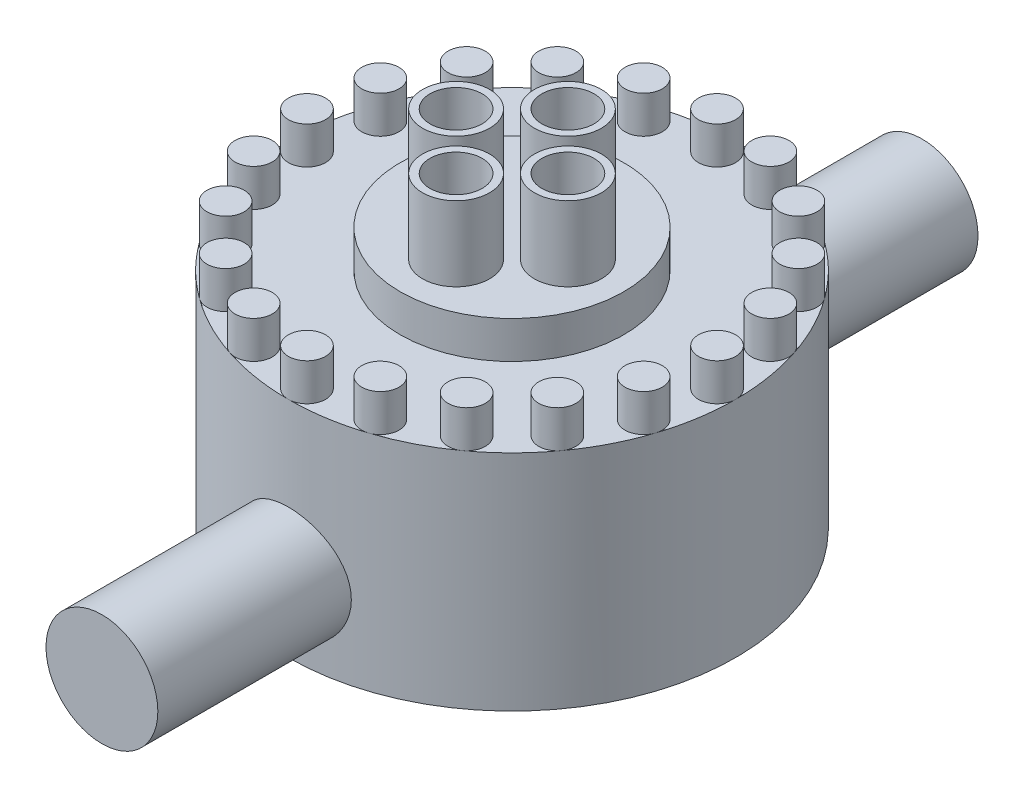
ISO-10303-21;
HEADER;
FILE_DESCRIPTION(('STEP AP214'),'2;1');
FILE_NAME('part.step','',(''),(''),'','','');
FILE_SCHEMA(('AUTOMOTIVE_DESIGN { 1 0 10303 214 1 1 1 1 }'));
ENDSEC;
DATA;
#1=APPLICATION_CONTEXT('core data for automotive mechanical design processes');
#2=APPLICATION_PROTOCOL_DEFINITION('international standard','automotive_design',2000,#1);
#3=PRODUCT_CONTEXT('',#1,'mechanical');
#4=PRODUCT('Part','Part','',(#3));
#5=PRODUCT_RELATED_PRODUCT_CATEGORY('part','',(#4));
#6=PRODUCT_DEFINITION_FORMATION('','',#4);
#7=PRODUCT_DEFINITION_CONTEXT('part definition',#1,'design');
#8=PRODUCT_DEFINITION('design','',#6,#7);
#9=PRODUCT_DEFINITION_SHAPE('','',#8);
#10=(LENGTH_UNIT() NAMED_UNIT(*) SI_UNIT(.MILLI.,.METRE.));
#11=(NAMED_UNIT(*) PLANE_ANGLE_UNIT() SI_UNIT($,.RADIAN.));
#12=(NAMED_UNIT(*) SI_UNIT($,.STERADIAN.) SOLID_ANGLE_UNIT());
#13=UNCERTAINTY_MEASURE_WITH_UNIT(LENGTH_MEASURE(1.E-05),#10,'distance_accuracy_value','');
#14=(GEOMETRIC_REPRESENTATION_CONTEXT(3) GLOBAL_UNCERTAINTY_ASSIGNED_CONTEXT((#13)) GLOBAL_UNIT_ASSIGNED_CONTEXT((#10,
#11,#12)) REPRESENTATION_CONTEXT('',''));
#15=CARTESIAN_POINT('',(0.,0.,0.));
#16=DIRECTION('',(0.,0.,1.));
#17=DIRECTION('',(1.,0.,0.));
#18=AXIS2_PLACEMENT_3D('',#15,#16,#17);
#19=CARTESIAN_POINT('',(0.,300.,0.));
#20=DIRECTION('',(0.,-1.,0.));
#21=DIRECTION('',(0.,0.,-1.));
#22=AXIS2_PLACEMENT_3D('',#19,#20,#21);
#23=CYLINDRICAL_SURFACE('',#22,300.);
#24=CARTESIAN_POINT('',(0.,177.505159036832,-300.));
#25=CARTESIAN_POINT('',(-2.07207530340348,177.505150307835,-299.999995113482));
#26=CARTESIAN_POINT('',(-4.14432592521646,177.419216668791,-299.978479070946));
#27=CARTESIAN_POINT('',(-8.27386108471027,177.076179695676,-299.892997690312));
#28=CARTESIAN_POINT('',(-10.3311438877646,176.819056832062,-299.829027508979));
#29=CARTESIAN_POINT('',(-14.4168013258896,176.135640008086,-299.660371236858));
#30=CARTESIAN_POINT('',(-16.44516075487,175.709260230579,-299.555664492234));
#31=CARTESIAN_POINT('',(-20.4574175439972,174.690877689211,-299.30842669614));
#32=CARTESIAN_POINT('',(-22.4413160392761,174.098879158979,-299.165896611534));
#33=CARTESIAN_POINT('',(-26.3485896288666,172.754821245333,-298.847100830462));
#34=CARTESIAN_POINT('',(-28.2720353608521,172.002957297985,-298.670876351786));
#35=CARTESIAN_POINT('',(-32.0480045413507,170.344510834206,-298.28933403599));
#36=CARTESIAN_POINT('',(-33.9005276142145,169.437927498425,-298.084016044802));
#37=CARTESIAN_POINT('',(-37.5225361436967,167.476696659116,-297.649771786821));
#38=CARTESIAN_POINT('',(-39.2920215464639,166.422049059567,-297.420845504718));
#39=CARTESIAN_POINT('',(-42.7366745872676,164.172077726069,-296.945449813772));
#40=CARTESIAN_POINT('',(-44.4118409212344,162.976752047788,-296.698980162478));
#41=CARTESIAN_POINT('',(-47.6873510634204,160.43010431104,-296.190334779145));
#42=CARTESIAN_POINT('',(-49.2857380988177,159.076306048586,-295.927952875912));
#43=CARTESIAN_POINT('',(-52.3633738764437,156.240213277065,-295.398909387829));
#44=CARTESIAN_POINT('',(-53.8426212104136,154.757917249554,-295.132247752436));
#45=CARTESIAN_POINT('',(-56.6724432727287,151.674393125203,-294.601947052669));
#46=CARTESIAN_POINT('',(-58.0230040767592,150.073152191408,-294.338308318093));
#47=CARTESIAN_POINT('',(-60.5862307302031,146.76226821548,-293.821405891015));
#48=CARTESIAN_POINT('',(-61.7988957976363,145.052624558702,-293.568142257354));
#49=CARTESIAN_POINT('',(-64.0949080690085,141.509830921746,-293.075489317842));
#50=CARTESIAN_POINT('',(-65.1760601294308,139.675220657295,-292.836362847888));
#51=CARTESIAN_POINT('',(-67.1795995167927,135.918235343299,-292.38323641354));
#52=CARTESIAN_POINT('',(-68.1019848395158,133.995859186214,-292.169236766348));
#53=CARTESIAN_POINT('',(-69.7806354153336,130.076993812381,-291.772869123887));
#54=CARTESIAN_POINT('',(-70.5369213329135,128.080513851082,-291.590497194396));
#55=CARTESIAN_POINT('',(-71.8772615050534,124.02758046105,-291.26300114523));
#56=CARTESIAN_POINT('',(-72.4613198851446,121.971128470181,-291.117876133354));
#57=CARTESIAN_POINT('',(-73.4422520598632,117.855127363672,-290.871941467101));
#58=CARTESIAN_POINT('',(-73.8426406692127,115.796465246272,-290.770302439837));
#59=CARTESIAN_POINT('',(-74.4697530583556,111.651184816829,-290.610324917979));
#60=CARTESIAN_POINT('',(-74.6964789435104,109.564566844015,-290.551985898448));
#61=CARTESIAN_POINT('',(-74.9742486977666,105.379194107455,-290.480434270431));
#62=CARTESIAN_POINT('',(-75.0253175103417,103.280441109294,-290.467215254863));
#63=CARTESIAN_POINT('',(-74.9513850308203,99.086262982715,-290.486301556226));
#64=CARTESIAN_POINT('',(-74.8263861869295,96.9908378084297,-290.518606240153));
#65=CARTESIAN_POINT('',(-74.4066068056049,92.8696822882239,-290.626396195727));
#66=CARTESIAN_POINT('',(-74.1160217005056,90.8434949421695,-290.700814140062));
#67=CARTESIAN_POINT('',(-73.3707302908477,86.8234878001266,-290.889813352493));
#68=CARTESIAN_POINT('',(-72.9160270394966,84.8296674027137,-291.004393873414));
#69=CARTESIAN_POINT('',(-71.8461494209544,80.8880016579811,-291.270379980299));
#70=CARTESIAN_POINT('',(-71.2309672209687,78.9401585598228,-291.421787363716));
#71=CARTESIAN_POINT('',(-69.8449207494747,75.1035642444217,-291.757082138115));
#72=CARTESIAN_POINT('',(-69.0740540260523,73.2148139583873,-291.940970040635));
#73=CARTESIAN_POINT('',(-67.3738390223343,69.4900235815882,-292.338049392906));
#74=CARTESIAN_POINT('',(-66.4429722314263,67.6547063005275,-292.551517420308));
#75=CARTESIAN_POINT('',(-64.4349710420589,64.0687509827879,-293.000328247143));
#76=CARTESIAN_POINT('',(-63.3578361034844,62.3181132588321,-293.235671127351));
#77=CARTESIAN_POINT('',(-61.0645447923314,58.9123078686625,-293.721798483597));
#78=CARTESIAN_POINT('',(-59.8483680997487,57.2571542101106,-293.972585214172));
#79=CARTESIAN_POINT('',(-57.2851461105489,54.0528978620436,-294.482799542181));
#80=CARTESIAN_POINT('',(-55.9380983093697,52.5037972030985,-294.742227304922));
#81=CARTESIAN_POINT('',(-53.0815266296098,49.4787343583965,-295.27024969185));
#82=CARTESIAN_POINT('',(-51.5684627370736,48.006121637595,-295.538894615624));
#83=CARTESIAN_POINT('',(-48.4230253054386,45.1931848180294,-296.070522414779));
#84=CARTESIAN_POINT('',(-46.7906494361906,43.8528633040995,-296.333505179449));
#85=CARTESIAN_POINT('',(-43.4172963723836,41.3136960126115,-296.846506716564));
#86=CARTESIAN_POINT('',(-41.6763149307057,40.1148557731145,-297.09652498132));
#87=CARTESIAN_POINT('',(-38.0973866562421,37.8672900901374,-297.576626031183));
#88=CARTESIAN_POINT('',(-36.2594404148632,36.8185637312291,-297.806708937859));
#89=CARTESIAN_POINT('',(-32.4924741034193,34.87568515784,-298.241254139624));
#90=CARTESIAN_POINT('',(-30.5631603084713,33.9820815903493,-298.445624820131));
#91=CARTESIAN_POINT('',(-26.6328715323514,32.36095865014,-298.821998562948));
#92=CARTESIAN_POINT('',(-24.6318961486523,31.6334402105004,-298.994001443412));
#93=CARTESIAN_POINT('',(-20.573013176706,30.3505999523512,-299.300671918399));
#94=CARTESIAN_POINT('',(-18.5151145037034,29.7952513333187,-299.435345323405));
#95=CARTESIAN_POINT('',(-14.3573435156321,28.8613804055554,-299.66347916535));
#96=CARTESIAN_POINT('',(-12.2574722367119,28.4828537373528,-299.75694061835));
#97=CARTESIAN_POINT('',(-8.0857855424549,27.9133504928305,-299.898089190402));
#98=CARTESIAN_POINT('',(-6.01462837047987,27.7178200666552,-299.946887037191));
#99=CARTESIAN_POINT('',(-1.86267736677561,27.4994806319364,-300.001400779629));
#100=CARTESIAN_POINT('',(0.21811629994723,27.4766686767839,-300.007117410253));
#101=CARTESIAN_POINT('',(4.37389326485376,27.6039543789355,-299.975310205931));
#102=CARTESIAN_POINT('',(6.44887703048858,27.7540376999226,-299.937789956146));
#103=CARTESIAN_POINT('',(10.5780268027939,28.2257984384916,-299.820565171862));
#104=CARTESIAN_POINT('',(12.6321928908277,28.5474751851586,-299.7408608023));
#105=CARTESIAN_POINT('',(16.6745850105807,29.3536531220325,-299.5429731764));
#106=CARTESIAN_POINT('',(18.6633372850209,29.8356646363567,-299.42537909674));
#107=CARTESIAN_POINT('',(22.5925573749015,30.9597056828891,-299.154566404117));
#108=CARTESIAN_POINT('',(24.533025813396,31.6017331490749,-299.001348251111));
#109=CARTESIAN_POINT('',(28.3528497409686,33.0409099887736,-298.663343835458));
#110=CARTESIAN_POINT('',(30.2322007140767,33.8380707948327,-298.478555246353));
#111=CARTESIAN_POINT('',(33.9174347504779,35.5815976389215,-298.082275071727));
#112=CARTESIAN_POINT('',(35.7233164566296,36.5279664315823,-297.870782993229));
#113=CARTESIAN_POINT('',(39.2814439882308,38.5812846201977,-297.422663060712));
#114=CARTESIAN_POINT('',(41.0321702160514,39.6907846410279,-297.185655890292));
#115=CARTESIAN_POINT('',(44.4343925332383,42.0496398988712,-296.696038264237));
#116=CARTESIAN_POINT('',(46.0858876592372,43.2989964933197,-296.443427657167));
#117=CARTESIAN_POINT('',(49.2794038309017,45.9293662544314,-295.92931072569));
#118=CARTESIAN_POINT('',(50.8214083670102,47.3103992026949,-295.667803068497));
#119=CARTESIAN_POINT('',(53.7858942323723,50.1949783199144,-295.142921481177));
#120=CARTESIAN_POINT('',(55.2083738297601,51.6985262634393,-294.879547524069));
#121=CARTESIAN_POINT('',(57.95806016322,54.8569250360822,-294.351612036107));
#122=CARTESIAN_POINT('',(59.2820658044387,56.5145864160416,-294.087180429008));
#123=CARTESIAN_POINT('',(61.7858172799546,59.9374588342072,-293.571366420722));
#124=CARTESIAN_POINT('',(62.9655604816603,61.7026718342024,-293.319984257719));
#125=CARTESIAN_POINT('',(65.172242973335,65.328781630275,-292.837591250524));
#126=CARTESIAN_POINT('',(66.1991858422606,67.1896761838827,-292.60657992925));
#127=CARTESIAN_POINT('',(68.0925281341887,70.9944826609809,-292.171784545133));
#128=CARTESIAN_POINT('',(68.9589297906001,72.9383934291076,-291.968000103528));
#129=CARTESIAN_POINT('',(70.5196229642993,76.8837602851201,-291.594964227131));
#130=CARTESIAN_POINT('',(71.2149159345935,78.8848011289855,-291.425512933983));
#131=CARTESIAN_POINT('',(72.4343634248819,82.9412079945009,-291.124814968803));
#132=CARTESIAN_POINT('',(72.9585181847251,84.9965739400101,-290.993568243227));
#133=CARTESIAN_POINT('',(73.8310954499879,89.1461344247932,-290.773403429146));
#134=CARTESIAN_POINT('',(74.1795502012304,91.2403217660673,-290.684477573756));
#135=CARTESIAN_POINT('',(74.6977632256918,95.4520939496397,-290.55174423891));
#136=CARTESIAN_POINT('',(74.8675257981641,97.5696782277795,-290.507935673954));
#137=CARTESIAN_POINT('',(75.0245416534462,101.751015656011,-290.467423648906));
#138=CARTESIAN_POINT('',(75.016902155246,103.814565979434,-290.469402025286));
#139=CARTESIAN_POINT('',(74.8316979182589,107.933485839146,-290.517170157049));
#140=CARTESIAN_POINT('',(74.6541366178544,109.988855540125,-290.562959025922));
#141=CARTESIAN_POINT('',(74.1306186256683,114.076556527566,-290.69696270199));
#142=CARTESIAN_POINT('',(73.7846664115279,116.10888842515,-290.785176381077));
#143=CARTESIAN_POINT('',(72.9272663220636,120.136166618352,-291.001389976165));
#144=CARTESIAN_POINT('',(72.415817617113,122.131112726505,-291.129390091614));
#145=CARTESIAN_POINT('',(71.2351253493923,126.057981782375,-291.420527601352));
#146=CARTESIAN_POINT('',(70.566844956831,127.990210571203,-291.583450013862));
#147=CARTESIAN_POINT('',(69.0760108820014,131.791202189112,-291.940219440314));
#148=CARTESIAN_POINT('',(68.2534583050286,133.659965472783,-292.134066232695));
#149=CARTESIAN_POINT('',(66.4600107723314,137.322174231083,-292.547283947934));
#150=CARTESIAN_POINT('',(65.4891000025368,139.115611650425,-292.766657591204));
#151=CARTESIAN_POINT('',(63.4057722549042,142.615706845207,-293.224905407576));
#152=CARTESIAN_POINT('',(62.2933522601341,144.322362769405,-293.463779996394));
#153=CARTESIAN_POINT('',(59.9036277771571,147.68163830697,-293.961022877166));
#154=CARTESIAN_POINT('',(58.6227781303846,149.33168569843,-294.219737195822));
#155=CARTESIAN_POINT('',(55.9285489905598,152.518672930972,-294.743753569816));
#156=CARTESIAN_POINT('',(54.5151671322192,154.055610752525,-295.009055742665));
#157=CARTESIAN_POINT('',(51.5648205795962,157.00675212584,-295.539025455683));
#158=CARTESIAN_POINT('',(50.0278275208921,158.420927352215,-295.80369283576));
#159=CARTESIAN_POINT('',(46.840496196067,161.116801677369,-296.325117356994));
#160=CARTESIAN_POINT('',(45.1901580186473,162.398500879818,-296.581874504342));
#161=CARTESIAN_POINT('',(41.7558862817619,164.842692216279,-297.085023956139));
#162=CARTESIAN_POINT('',(39.9700725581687,166.002600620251,-297.331143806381));
#163=CARTESIAN_POINT('',(36.3039790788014,168.167575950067,-297.801000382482));
#164=CARTESIAN_POINT('',(34.4236948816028,169.172635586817,-298.024736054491));
#165=CARTESIAN_POINT('',(30.5829989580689,171.019522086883,-298.443309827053));
#166=CARTESIAN_POINT('',(28.6226392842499,171.861453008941,-298.638166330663));
#167=CARTESIAN_POINT('',(24.6347352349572,173.37600958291,-298.993536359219));
#168=CARTESIAN_POINT('',(22.6072010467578,174.04866077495,-299.154055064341));
#169=CARTESIAN_POINT('',(18.887165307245,175.108731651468,-299.409531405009));
#170=CARTESIAN_POINT('',(17.2035586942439,175.526017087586,-299.511143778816));
#171=CARTESIAN_POINT('',(13.8102535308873,176.243094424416,-299.686772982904));
#172=CARTESIAN_POINT('',(12.1005587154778,176.542902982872,-299.760793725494));
#173=CARTESIAN_POINT('',(8.66360069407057,177.023295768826,-299.879806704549));
#174=CARTESIAN_POINT('',(6.93633857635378,177.203887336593,-299.924800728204));
#175=CARTESIAN_POINT('',(3.4727594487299,177.444830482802,-299.984901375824));
#176=CARTESIAN_POINT('',(1.73644128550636,177.505166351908,-300.000004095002));
#177=CARTESIAN_POINT('',(0.,177.505159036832,-300.));
#178=B_SPLINE_CURVE_WITH_KNOTS('',3,(#24,#25,#26,#27,#28,#29,#30,#31,#32,#33,#34,#35,#36,#37,
#38,#39,#40,#41,#42,#43,#44,#45,#46,#47,#48,#49,#50,#51,#52,#53,#54,#55,#56,#57,#58,#59,#60,#61,
#62,#63,#64,#65,#66,#67,#68,#69,#70,#71,#72,#73,#74,#75,#76,#77,#78,#79,#80,#81,#82,#83,#84,#85,
#86,#87,#88,#89,#90,#91,#92,#93,#94,#95,#96,#97,#98,#99,#100,#101,#102,#103,#104,#105,#106,#107,
#108,#109,#110,#111,#112,#113,#114,#115,#116,#117,#118,#119,#120,#121,#122,#123,#124,#125,#126,
#127,#128,#129,#130,#131,#132,#133,#134,#135,#136,#137,#138,#139,#140,#141,#142,#143,#144,#145,
#146,#147,#148,#149,#150,#151,#152,#153,#154,#155,#156,#157,#158,#159,#160,#161,#162,#163,#164,
#165,#166,#167,#168,#169,#170,#171,#172,#173,#174,#175,#176,#177),.UNSPECIFIED.,.T.,.F.,(4,2,2,
2,2,2,2,2,2,2,2,2,2,2,2,2,2,2,2,2,2,2,2,2,2,2,2,2,2,2,2,2,2,2,2,2,2,2,2,2,2,2,2,2,2,2,2,2,2,2,2,
2,2,2,2,2,2,2,2,2,2,2,2,2,2,2,2,2,2,2,2,2,2,2,2,2,4),(0.,6.21464317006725,12.4299954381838,
18.6485030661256,24.8668517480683,31.0776417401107,37.2884646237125,43.4992915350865,
49.7102042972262,56.0359840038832,62.3618384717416,68.6883766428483,75.0149506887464,
81.4357556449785,87.8566416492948,94.2767283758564,100.696661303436,106.988009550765,
113.279281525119,119.569660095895,125.859951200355,131.997533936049,138.135002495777,
144.272770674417,150.410635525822,156.610341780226,162.810070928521,169.010707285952,
175.21146233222,181.589198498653,187.967059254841,194.345169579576,200.723241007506,
207.123430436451,213.52365582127,219.922884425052,226.321955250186,232.557185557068,
238.792309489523,245.026916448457,251.261499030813,257.403469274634,263.545360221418,
269.687703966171,275.830161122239,282.081573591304,288.333046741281,294.585460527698,
300.837964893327,307.244150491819,313.650452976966,320.056605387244,326.46266867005,
332.830296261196,339.197914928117,345.564364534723,351.930660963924,358.113911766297,
364.2970374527,370.479998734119,376.662991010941,382.80896118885,388.954887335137,
395.101469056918,401.248181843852,407.555293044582,413.862516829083,420.1711920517,
426.479862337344,432.902955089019,439.326350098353,445.745634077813,452.163948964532,
457.372325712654,462.579963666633,467.787280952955,472.995278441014),.UNSPECIFIED.);
#179=CARTESIAN_POINT('',(0.,177.505159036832,-300.));
#180=VERTEX_POINT('',#179);
#181=EDGE_CURVE('E44',#180,#180,#178,.T.);
#182=ORIENTED_EDGE('',*,*,#181,.T.);
#183=EDGE_LOOP('',(#182));
#184=FACE_BOUND('',#183,.T.);
#185=CARTESIAN_POINT('',(0.,300.,0.));
#186=DIRECTION('',(0.,1.,0.));
#187=DIRECTION('',(0.,0.,1.));
#188=AXIS2_PLACEMENT_3D('',#185,#186,#187);
#189=CIRCLE('',#188,300.);
#190=CARTESIAN_POINT('',(-92.7050983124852,300.,-285.316954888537));
#191=VERTEX_POINT('',#190);
#192=CARTESIAN_POINT('',(-176.335575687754,300.,-242.705098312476));
#193=VERTEX_POINT('',#192);
#194=EDGE_CURVE('E53',#191,#193,#189,.T.);
#195=ORIENTED_EDGE('',*,*,#194,.F.);
#196=CARTESIAN_POINT('',(0.,300.,-300.));
#197=VERTEX_POINT('',#196);
#198=EDGE_CURVE('E120',#197,#191,#189,.T.);
#199=ORIENTED_EDGE('',*,*,#198,.F.);
#200=CARTESIAN_POINT('',(92.7050983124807,300.,-285.316954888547));
#201=VERTEX_POINT('',#200);
#202=EDGE_CURVE('E129',#201,#197,#189,.T.);
#203=ORIENTED_EDGE('',*,*,#202,.F.);
#204=CARTESIAN_POINT('',(176.33557568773,300.,-242.705098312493));
#205=VERTEX_POINT('',#204);
#206=EDGE_CURVE('E604',#205,#201,#189,.T.);
#207=ORIENTED_EDGE('',*,*,#206,.F.);
#208=CARTESIAN_POINT('',(242.705098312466,300.,-176.335575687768));
#209=VERTEX_POINT('',#208);
#210=EDGE_CURVE('E600',#209,#205,#189,.T.);
#211=ORIENTED_EDGE('',*,*,#210,.F.);
#212=CARTESIAN_POINT('',(285.31695488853,300.,-92.7050983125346));
#213=VERTEX_POINT('',#212);
#214=EDGE_CURVE('E596',#213,#209,#189,.T.);
#215=ORIENTED_EDGE('',*,*,#214,.F.);
#216=CARTESIAN_POINT('',(300.,300.,-7.66835063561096E-11));
#217=VERTEX_POINT('',#216);
#218=EDGE_CURVE('E592',#217,#213,#189,.T.);
#219=ORIENTED_EDGE('',*,*,#218,.F.);
#220=CARTESIAN_POINT('',(285.316954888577,300.,92.7050983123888));
#221=VERTEX_POINT('',#220);
#222=EDGE_CURVE('E588',#221,#217,#189,.T.);
#223=ORIENTED_EDGE('',*,*,#222,.F.);
#224=CARTESIAN_POINT('',(242.705098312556,300.,176.335575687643));
#225=VERTEX_POINT('',#224);
#226=EDGE_CURVE('E584',#225,#221,#189,.T.);
#227=ORIENTED_EDGE('',*,*,#226,.F.);
#228=CARTESIAN_POINT('',(176.335575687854,300.,242.705098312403));
#229=VERTEX_POINT('',#228);
#230=EDGE_CURVE('E580',#229,#225,#189,.T.);
#231=ORIENTED_EDGE('',*,*,#230,.F.);
#232=CARTESIAN_POINT('',(92.7050983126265,300.,285.3169548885));
#233=VERTEX_POINT('',#232);
#234=EDGE_CURVE('E576',#233,#229,#189,.T.);
#235=ORIENTED_EDGE('',*,*,#234,.F.);
#236=CARTESIAN_POINT('',(1.53367012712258E-10,300.,300.));
#237=VERTEX_POINT('',#236);
#238=EDGE_CURVE('E572',#237,#233,#189,.T.);
#239=ORIENTED_EDGE('',*,*,#238,.F.);
#240=CARTESIAN_POINT('',(-92.7050983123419,300.,285.316954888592));
#241=VERTEX_POINT('',#240);
#242=EDGE_CURVE('E568',#241,#237,#189,.T.);
#243=ORIENTED_EDGE('',*,*,#242,.F.);
#244=CARTESIAN_POINT('',(-176.33557568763,300.,242.705098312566));
#245=VERTEX_POINT('',#244);
#246=EDGE_CURVE('E564',#245,#241,#189,.T.);
#247=ORIENTED_EDGE('',*,*,#246,.F.);
#248=CARTESIAN_POINT('',(-242.705098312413,300.,176.335575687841));
#249=VERTEX_POINT('',#248);
#250=EDGE_CURVE('E560',#249,#245,#189,.T.);
#251=ORIENTED_EDGE('',*,*,#250,.F.);
#252=CARTESIAN_POINT('',(-285.316954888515,300.,92.7050983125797));
#253=VERTEX_POINT('',#252);
#254=EDGE_CURVE('E557',#253,#249,#189,.T.);
#255=ORIENTED_EDGE('',*,*,#254,.F.);
#256=CARTESIAN_POINT('',(-300.,300.,7.67202457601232E-11));
#257=VERTEX_POINT('',#256);
#258=EDGE_CURVE('E554',#257,#253,#189,.T.);
#259=ORIENTED_EDGE('',*,*,#258,.F.);
#260=CARTESIAN_POINT('',(-285.316954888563,300.,-92.7050983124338));
#261=VERTEX_POINT('',#260);
#262=EDGE_CURVE('E553',#261,#257,#189,.T.);
#263=ORIENTED_EDGE('',*,*,#262,.F.);
#264=CARTESIAN_POINT('',(-242.705098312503,300.,-176.335575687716));
#265=VERTEX_POINT('',#264);
#266=EDGE_CURVE('E138',#265,#261,#189,.T.);
#267=ORIENTED_EDGE('',*,*,#266,.F.);
#268=EDGE_CURVE('E136',#193,#265,#189,.T.);
#269=ORIENTED_EDGE('',*,*,#268,.F.);
#270=EDGE_LOOP('',(#195,#199,#203,#207,#211,#215,#219,#223,#227,#231,#235,#239,#243,#247,#251,
#255,#259,#263,#267,#269));
#271=FACE_BOUND('',#270,.T.);
#272=CARTESIAN_POINT('',(0.,0.,0.));
#273=DIRECTION('',(0.,1.,0.));
#274=DIRECTION('',(0.,0.,1.));
#275=AXIS2_PLACEMENT_3D('',#272,#273,#274);
#276=CIRCLE('',#275,300.);
#277=CARTESIAN_POINT('',(0.,0.,300.));
#278=VERTEX_POINT('',#277);
#279=EDGE_CURVE('E130',#278,#278,#276,.T.);
#280=ORIENTED_EDGE('',*,*,#279,.T.);
#281=EDGE_LOOP('',(#280));
#282=FACE_BOUND('',#281,.T.);
#283=CARTESIAN_POINT('',(-75.,100.,290.473750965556));
#284=CARTESIAN_POINT('',(-74.9999911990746,97.9290643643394,290.473756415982));
#285=CARTESIAN_POINT('',(-74.9141513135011,95.8579528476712,290.495958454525));
#286=CARTESIAN_POINT('',(-74.5714973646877,91.7307281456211,290.584105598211));
#287=CARTESIAN_POINT('',(-74.3146636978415,89.6746167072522,290.650055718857));
#288=CARTESIAN_POINT('',(-73.6320370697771,85.5913231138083,290.823738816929));
#289=CARTESIAN_POINT('',(-73.2061562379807,83.5641565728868,290.931493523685));
#290=CARTESIAN_POINT('',(-72.1890046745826,79.5543144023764,291.185545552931));
#291=CARTESIAN_POINT('',(-71.5977380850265,77.5716376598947,291.331841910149));
#292=CARTESIAN_POINT('',(-70.2554470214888,73.6669648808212,291.658444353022));
#293=CARTESIAN_POINT('',(-69.5046324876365,71.7448928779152,291.83870571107));
#294=CARTESIAN_POINT('',(-67.8485395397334,67.9715593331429,292.228162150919));
#295=CARTESIAN_POINT('',(-66.9432603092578,66.1202981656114,292.437357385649));
#296=CARTESIAN_POINT('',(-64.9848406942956,62.5006000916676,292.878776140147));
#297=CARTESIAN_POINT('',(-63.9316990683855,60.7321638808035,293.110999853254));
#298=CARTESIAN_POINT('',(-61.6848812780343,57.2893344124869,293.592055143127));
#299=CARTESIAN_POINT('',(-60.4912030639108,55.6149425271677,293.840886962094));
#300=CARTESIAN_POINT('',(-57.9462358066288,52.3384674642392,294.35344631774));
#301=CARTESIAN_POINT('',(-56.5922884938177,50.7384794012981,294.61737149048));
#302=CARTESIAN_POINT('',(-53.7555578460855,47.65761905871,295.148135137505));
#303=CARTESIAN_POINT('',(-52.2727729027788,46.1767482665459,295.414973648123));
#304=CARTESIAN_POINT('',(-49.1879442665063,43.3437383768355,295.94424279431));
#305=CARTESIAN_POINT('',(-47.5858897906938,41.9916109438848,296.206673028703));
#306=CARTESIAN_POINT('',(-44.2730515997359,39.4253595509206,296.719911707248));
#307=CARTESIAN_POINT('',(-42.5622674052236,38.2112361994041,296.970720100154));
#308=CARTESIAN_POINT('',(-39.0184936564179,35.9135069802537,297.457223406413));
#309=CARTESIAN_POINT('',(-37.1841291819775,34.8319649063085,297.692657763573));
#310=CARTESIAN_POINT('',(-33.4275922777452,32.8276225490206,298.137842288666));
#311=CARTESIAN_POINT('',(-31.5054187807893,31.9048241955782,298.347592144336));
#312=CARTESIAN_POINT('',(-27.5869590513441,30.2253426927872,298.735392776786));
#313=CARTESIAN_POINT('',(-25.5906812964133,29.4686406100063,298.913447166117));
#314=CARTESIAN_POINT('',(-21.5382202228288,28.1274737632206,299.232744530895));
#315=CARTESIAN_POINT('',(-19.4820382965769,27.5430049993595,299.373988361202));
#316=CARTESIAN_POINT('',(-15.36713138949,26.5613568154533,299.613104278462));
#317=CARTESIAN_POINT('',(-13.309301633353,26.1606233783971,299.711796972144));
#318=CARTESIAN_POINT('',(-9.16575708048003,25.5326952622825,299.867115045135));
#319=CARTESIAN_POINT('',(-7.08004262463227,25.3054984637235,299.923740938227));
#320=CARTESIAN_POINT('',(-2.89645419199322,25.0266375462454,299.993311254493));
#321=CARTESIAN_POINT('',(-0.798581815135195,24.9749508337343,300.0062613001));
#322=CARTESIAN_POINT('',(3.39391325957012,25.0475033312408,299.988125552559));
#323=CARTESIAN_POINT('',(5.48853599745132,25.1717403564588,299.957040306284));
#324=CARTESIAN_POINT('',(9.61253943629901,25.5903298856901,299.85289595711));
#325=CARTESIAN_POINT('',(11.642335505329,25.8808402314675,299.780785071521));
#326=CARTESIAN_POINT('',(15.6695864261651,26.6265873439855,299.597275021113));
#327=CARTESIAN_POINT('',(17.6670418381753,27.0818212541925,299.485876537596));
#328=CARTESIAN_POINT('',(21.6158979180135,28.1533672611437,299.22678463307));
#329=CARTESIAN_POINT('',(23.5672970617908,28.7696846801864,299.079090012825));
#330=CARTESIAN_POINT('',(27.4108516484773,30.1586018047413,298.751344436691));
#331=CARTESIAN_POINT('',(29.3030062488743,30.9312037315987,298.571293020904));
#332=CARTESIAN_POINT('',(33.0324032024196,32.6345737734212,298.181836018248));
#333=CARTESIAN_POINT('',(34.868996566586,33.5667052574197,297.972180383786));
#334=CARTESIAN_POINT('',(38.4572962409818,35.577439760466,297.53034251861));
#335=CARTESIAN_POINT('',(40.209002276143,36.6560432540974,297.298160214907));
#336=CARTESIAN_POINT('',(43.6166620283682,38.9524055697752,296.8173655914));
#337=CARTESIAN_POINT('',(45.2726017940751,40.1701845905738,296.568750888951));
#338=CARTESIAN_POINT('',(48.478105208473,42.7366689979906,296.061660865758));
#339=CARTESIAN_POINT('',(50.0276668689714,44.0853768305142,295.803185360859));
#340=CARTESIAN_POINT('',(53.0511555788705,46.9432533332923,295.2761308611));
#341=CARTESIAN_POINT('',(54.5218967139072,48.4557790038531,295.00746784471));
#342=CARTESIAN_POINT('',(57.331146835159,51.5997531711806,294.47442046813));
#343=CARTESIAN_POINT('',(58.6696533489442,53.2312038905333,294.210036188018));
#344=CARTESIAN_POINT('',(61.2053507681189,56.6023755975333,293.693002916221));
#345=CARTESIAN_POINT('',(62.4025340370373,58.3421024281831,293.440354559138));
#346=CARTESIAN_POINT('',(64.6470098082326,61.9182373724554,292.954063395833));
#347=CARTESIAN_POINT('',(65.6943030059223,63.7546450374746,292.720420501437));
#348=CARTESIAN_POINT('',(67.6359757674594,67.5210007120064,292.277901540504));
#349=CARTESIAN_POINT('',(68.5295834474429,69.45136180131,292.0691520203));
#350=CARTESIAN_POINT('',(70.1505724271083,73.3838381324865,291.684061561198));
#351=CARTESIAN_POINT('',(70.8779526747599,75.3859538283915,291.50772082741));
#352=CARTESIAN_POINT('',(72.1603484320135,79.447195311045,291.192926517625));
#353=CARTESIAN_POINT('',(72.7153941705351,81.5063110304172,291.054466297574));
#354=CARTESIAN_POINT('',(73.6484795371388,85.6666197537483,290.819761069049));
#355=CARTESIAN_POINT('',(74.0265238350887,87.7678116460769,290.723514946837));
#356=CARTESIAN_POINT('',(74.5946302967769,91.9404237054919,290.57825918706));
#357=CARTESIAN_POINT('',(74.7893957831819,94.0111634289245,290.528068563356));
#358=CARTESIAN_POINT('',(75.0062802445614,98.1622508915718,290.472151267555));
#359=CARTESIAN_POINT('',(75.0284022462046,100.242598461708,290.46642381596));
#360=CARTESIAN_POINT('',(74.8998153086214,104.397399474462,290.49960753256));
#361=CARTESIAN_POINT('',(74.7491210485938,106.471853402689,290.538514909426));
#362=CARTESIAN_POINT('',(74.2762388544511,110.599822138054,290.659766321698));
#363=CARTESIAN_POINT('',(73.9540516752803,112.653337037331,290.742110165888));
#364=CARTESIAN_POINT('',(73.1476215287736,116.691149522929,290.946034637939));
#365=CARTESIAN_POINT('',(72.6661231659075,118.676029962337,291.06694957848));
#366=CARTESIAN_POINT('',(71.5437596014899,122.597565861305,291.344854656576));
#367=CARTESIAN_POINT('',(70.9028966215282,124.534221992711,291.501844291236));
#368=CARTESIAN_POINT('',(69.4666740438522,128.34662171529,291.847436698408));
#369=CARTESIAN_POINT('',(68.671300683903,130.222359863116,292.036042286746));
#370=CARTESIAN_POINT('',(66.9319355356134,133.900665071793,292.439587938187));
#371=CARTESIAN_POINT('',(65.9879407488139,135.703230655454,292.654528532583));
#372=CARTESIAN_POINT('',(63.9380270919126,139.258389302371,293.109283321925));
#373=CARTESIAN_POINT('',(62.8292956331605,141.009308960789,293.349502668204));
#374=CARTESIAN_POINT('',(60.4719095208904,144.412074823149,293.844513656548));
#375=CARTESIAN_POINT('',(59.223253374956,146.063919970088,294.099305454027));
#376=CARTESIAN_POINT('',(56.594165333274,149.258299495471,294.616522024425));
#377=CARTESIAN_POINT('',(55.2137145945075,150.800818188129,294.878947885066));
#378=CARTESIAN_POINT('',(52.330125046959,153.766492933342,295.404308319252));
#379=CARTESIAN_POINT('',(50.826984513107,155.189647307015,295.667242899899));
#380=CARTESIAN_POINT('',(47.6684637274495,157.941468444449,296.193085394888));
#381=CARTESIAN_POINT('',(46.0102125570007,159.266874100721,296.455827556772));
#382=CARTESIAN_POINT('',(42.5858690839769,161.773343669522,296.967069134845));
#383=CARTESIAN_POINT('',(40.8197747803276,162.954404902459,297.215568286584));
#384=CARTESIAN_POINT('',(37.1916897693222,165.163554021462,297.691324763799));
#385=CARTESIAN_POINT('',(35.3297020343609,166.191646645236,297.918582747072));
#386=CARTESIAN_POINT('',(31.5225730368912,168.087068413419,298.345430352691));
#387=CARTESIAN_POINT('',(29.5774330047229,168.954399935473,298.545020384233));
#388=CARTESIAN_POINT('',(25.6321850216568,170.515662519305,298.909495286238));
#389=CARTESIAN_POINT('',(23.6325836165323,171.210816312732,299.074623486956));
#390=CARTESIAN_POINT('',(19.5792076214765,172.430198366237,299.367304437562));
#391=CARTESIAN_POINT('',(17.5254331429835,172.95442697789,299.494857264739));
#392=CARTESIAN_POINT('',(13.3791355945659,173.827409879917,299.708703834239));
#393=CARTESIAN_POINT('',(11.2866188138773,174.176192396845,299.79500421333));
#394=CARTESIAN_POINT('',(7.07824618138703,174.695335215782,299.92387303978));
#395=CARTESIAN_POINT('',(4.96239084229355,174.865699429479,299.966442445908));
#396=CARTESIAN_POINT('',(0.780846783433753,175.024321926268,300.006072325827));
#397=CARTESIAN_POINT('',(-1.28464986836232,175.017383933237,300.004333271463));
#398=CARTESIAN_POINT('',(-5.4075353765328,174.833257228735,299.95834444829));
#399=CARTESIAN_POINT('',(-7.46492438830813,174.65607179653,299.914095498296));
#400=CARTESIAN_POINT('',(-11.5567251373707,174.132962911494,299.784309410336));
#401=CARTESIAN_POINT('',(-13.5911376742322,173.787045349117,299.698773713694));
#402=CARTESIAN_POINT('',(-17.6226332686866,172.929349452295,299.488759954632));
#403=CARTESIAN_POINT('',(-19.6197161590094,172.417570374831,299.364281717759));
#404=CARTESIAN_POINT('',(-23.5519798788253,171.235500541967,299.080540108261));
#405=CARTESIAN_POINT('',(-25.4874373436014,170.566083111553,298.921468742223));
#406=CARTESIAN_POINT('',(-29.2947283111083,169.07242993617,298.572392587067));
#407=CARTESIAN_POINT('',(-31.1665622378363,168.248195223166,298.382388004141));
#408=CARTESIAN_POINT('',(-34.8346163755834,166.45089319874,297.976433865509));
#409=CARTESIAN_POINT('',(-36.6308293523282,165.477811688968,297.760481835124));
#410=CARTESIAN_POINT('',(-40.1360882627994,163.38971858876,297.308287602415));
#411=CARTESIAN_POINT('',(-41.8451324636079,162.274704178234,297.072044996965));
#412=CARTESIAN_POINT('',(-45.2052220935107,159.881909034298,296.579567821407));
#413=CARTESIAN_POINT('',(-46.8538963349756,158.600868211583,296.322989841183));
#414=CARTESIAN_POINT('',(-50.0380666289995,155.906544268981,295.801952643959));
#415=CARTESIAN_POINT('',(-51.5735607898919,154.493258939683,295.537493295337));
#416=CARTESIAN_POINT('',(-54.5218031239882,151.543403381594,295.007825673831));
#417=CARTESIAN_POINT('',(-55.934521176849,150.006803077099,294.74261723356));
#418=CARTESIAN_POINT('',(-58.6275104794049,146.820573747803,294.218791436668));
#419=CARTESIAN_POINT('',(-59.9077816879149,145.170944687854,293.960174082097));
#420=CARTESIAN_POINT('',(-62.3498570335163,141.737462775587,293.452006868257));
#421=CARTESIAN_POINT('',(-63.5090011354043,139.951678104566,293.20271666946));
#422=CARTESIAN_POINT('',(-65.6724663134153,136.285769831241,292.725733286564));
#423=CARTESIAN_POINT('',(-66.6767800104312,134.405641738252,292.49804113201));
#424=CARTESIAN_POINT('',(-68.52223077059,130.56533243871,292.071225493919));
#425=CARTESIAN_POINT('',(-69.3634733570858,128.605204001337,291.872083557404));
#426=CARTESIAN_POINT('',(-70.8767376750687,124.617753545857,291.508309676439));
#427=CARTESIAN_POINT('',(-71.5487852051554,122.590441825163,291.343672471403));
#428=CARTESIAN_POINT('',(-72.6074820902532,118.871987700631,291.081416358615));
#429=CARTESIAN_POINT('',(-73.0240689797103,117.189774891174,290.977011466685));
#430=CARTESIAN_POINT('',(-73.7399611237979,113.79924684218,290.796414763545));
#431=CARTESIAN_POINT('',(-74.0392830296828,112.090935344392,290.720218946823));
#432=CARTESIAN_POINT('',(-74.5189006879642,108.656740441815,290.597651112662));
#433=CARTESIAN_POINT('',(-74.6992048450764,106.93085828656,290.551276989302));
#434=CARTESIAN_POINT('',(-74.9397660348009,103.470026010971,290.489322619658));
#435=CARTESIAN_POINT('',(-75.000007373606,101.735074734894,290.473746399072));
#436=CARTESIAN_POINT('',(-75.,100.,290.473750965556));
#437=B_SPLINE_CURVE_WITH_KNOTS('',3,(#283,#284,#285,#286,#287,#288,#289,#290,#291,#292,#293,
#294,#295,#296,#297,#298,#299,#300,#301,#302,#303,#304,#305,#306,#307,#308,#309,#310,#311,#312,
#313,#314,#315,#316,#317,#318,#319,#320,#321,#322,#323,#324,#325,#326,#327,#328,#329,#330,#331,
#332,#333,#334,#335,#336,#337,#338,#339,#340,#341,#342,#343,#344,#345,#346,#347,#348,#349,#350,
#351,#352,#353,#354,#355,#356,#357,#358,#359,#360,#361,#362,#363,#364,#365,#366,#367,#368,#369,
#370,#371,#372,#373,#374,#375,#376,#377,#378,#379,#380,#381,#382,#383,#384,#385,#386,#387,#388,
#389,#390,#391,#392,#393,#394,#395,#396,#397,#398,#399,#400,#401,#402,#403,#404,#405,#406,#407,
#408,#409,#410,#411,#412,#413,#414,#415,#416,#417,#418,#419,#420,#421,#422,#423,#424,#425,#426,
#427,#428,#429,#430,#431,#432,#433,#434,#435,#436),.UNSPECIFIED.,.T.,.F.,(4,2,2,2,2,2,2,2,2,2,2,
2,2,2,2,2,2,2,2,2,2,2,2,2,2,2,2,2,2,2,2,2,2,2,2,2,2,2,2,2,2,2,2,2,2,2,2,2,2,2,2,2,2,2,2,2,2,2,2,
2,2,2,2,2,2,2,2,2,2,2,2,2,2,2,2,2,4),(0.,6.21122119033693,12.4231545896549,18.6383211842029,
24.8533321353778,31.0602151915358,37.2671310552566,43.4740990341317,49.6811575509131,
56.0114279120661,62.3417773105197,68.6726997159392,75.0036500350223,81.4231790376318,
87.8427860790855,94.2616609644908,100.680386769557,106.969091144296,113.257718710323,
119.545536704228,125.83327661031,131.981272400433,138.129161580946,144.277253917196,
150.42543364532,156.629051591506,162.832689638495,169.037229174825,175.241884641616,
181.614616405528,187.987467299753,194.360662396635,200.733827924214,207.138122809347,
213.542458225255,219.945669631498,226.348712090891,232.5825588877,238.816296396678,
245.049504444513,251.282685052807,257.413633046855,263.544495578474,269.675904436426,
275.807437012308,282.059222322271,288.311074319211,294.563821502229,300.816656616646,
307.226168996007,313.635800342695,320.0452331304,326.454571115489,332.816996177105,
339.179408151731,345.540796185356,351.902044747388,358.091132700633,364.280101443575,
370.468854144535,376.65763456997,382.812903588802,388.968131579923,395.123947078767,
401.279884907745,407.583336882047,413.886894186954,420.191993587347,426.497094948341,
432.919988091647,439.343187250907,445.762215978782,452.180265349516,457.384587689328,
462.58817076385,467.791386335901,472.99528199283),.UNSPECIFIED.);
#438=CARTESIAN_POINT('',(-75.,100.,290.473750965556));
#439=VERTEX_POINT('',#438);
#440=EDGE_CURVE('E11',#439,#439,#437,.T.);
#441=ORIENTED_EDGE('',*,*,#440,.F.);
#442=EDGE_LOOP('',(#441));
#443=FACE_BOUND('',#442,.T.);
#444=ADVANCED_FACE('F40',(#184,#271,#282,#443),#23,.T.);
#445=CARTESIAN_POINT('',(0.,350.,0.));
#446=DIRECTION('',(0.,1.,0.));
#447=DIRECTION('',(0.,0.,1.));
#448=AXIS2_PLACEMENT_3D('',#445,#446,#447);
#449=PLANE('',#448);
#450=CARTESIAN_POINT('',(-5.2372220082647E-13,350.,75.));
#451=DIRECTION('',(0.,1.,0.));
#452=DIRECTION('',(0.,0.,1.));
#453=AXIS2_PLACEMENT_3D('',#450,#451,#452);
#454=CIRCLE('',#453,45.);
#455=CARTESIAN_POINT('',(-5.2372220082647E-13,350.,120.));
#456=VERTEX_POINT('',#455);
#457=EDGE_CURVE('E408',#456,#456,#454,.T.);
#458=ORIENTED_EDGE('',*,*,#457,.F.);
#459=EDGE_LOOP('',(#458));
#460=FACE_BOUND('',#459,.T.);
#461=CARTESIAN_POINT('',(0.,350.,-75.));
#462=DIRECTION('',(0.,1.,0.));
#463=DIRECTION('',(0.,0.,1.));
#464=AXIS2_PLACEMENT_3D('',#461,#462,#463);
#465=CIRCLE('',#464,45.);
#466=CARTESIAN_POINT('',(0.,350.,-30.));
#467=VERTEX_POINT('',#466);
#468=EDGE_CURVE('E426',#467,#467,#465,.T.);
#469=ORIENTED_EDGE('',*,*,#468,.F.);
#470=EDGE_LOOP('',(#469));
#471=FACE_BOUND('',#470,.T.);
#472=CARTESIAN_POINT('',(0.,350.,0.));
#473=DIRECTION('',(0.,1.,0.));
#474=DIRECTION('',(0.,0.,1.));
#475=AXIS2_PLACEMENT_3D('',#472,#473,#474);
#476=CIRCLE('',#475,150.);
#477=CARTESIAN_POINT('',(0.,350.,150.));
#478=VERTEX_POINT('',#477);
#479=EDGE_CURVE('E444',#478,#478,#476,.T.);
#480=ORIENTED_EDGE('',*,*,#479,.T.);
#481=EDGE_LOOP('',(#480));
#482=FACE_BOUND('',#481,.T.);
#483=CARTESIAN_POINT('',(75.,350.,2.61861100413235E-13));
#484=DIRECTION('',(0.,1.,0.));
#485=DIRECTION('',(0.,0.,1.));
#486=AXIS2_PLACEMENT_3D('',#483,#484,#485);
#487=CIRCLE('',#486,45.);
#488=CARTESIAN_POINT('',(75.,350.,45.0000000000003));
#489=VERTEX_POINT('',#488);
#490=EDGE_CURVE('E417',#489,#489,#487,.T.);
#491=ORIENTED_EDGE('',*,*,#490,.F.);
#492=EDGE_LOOP('',(#491));
#493=FACE_BOUND('',#492,.T.);
#494=CARTESIAN_POINT('',(-75.,350.,-7.85583301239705E-13));
#495=DIRECTION('',(0.,1.,0.));
#496=DIRECTION('',(0.,0.,1.));
#497=AXIS2_PLACEMENT_3D('',#494,#495,#496);
#498=CIRCLE('',#497,45.);
#499=CARTESIAN_POINT('',(-75.,350.,44.9999999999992));
#500=VERTEX_POINT('',#499);
#501=EDGE_CURVE('E399',#500,#500,#498,.T.);
#502=ORIENTED_EDGE('',*,*,#501,.F.);
#503=EDGE_LOOP('',(#502));
#504=FACE_BOUND('',#503,.T.);
#505=ADVANCED_FACE('F204',(#460,#471,#482,#493,#504),#449,.T.);
#506=CARTESIAN_POINT('',(0.,300.,0.));
#507=DIRECTION('',(0.,1.,0.));
#508=DIRECTION('',(0.,0.,1.));
#509=AXIS2_PLACEMENT_3D('',#506,#507,#508);
#510=PLANE('',#509);
#511=CARTESIAN_POINT('',(0.,300.,0.));
#512=DIRECTION('',(0.,1.,0.));
#513=DIRECTION('',(0.,0.,1.));
#514=AXIS2_PLACEMENT_3D('',#511,#512,#513);
#515=CIRCLE('',#514,150.);
#516=CARTESIAN_POINT('',(0.,300.,150.));
#517=VERTEX_POINT('',#516);
#518=EDGE_CURVE('E435',#517,#517,#515,.T.);
#519=ORIENTED_EDGE('',*,*,#518,.F.);
#520=EDGE_LOOP('',(#519));
#521=FACE_BOUND('',#520,.T.);
#522=ORIENTED_EDGE('',*,*,#202,.T.);
#523=CARTESIAN_POINT('',(0.,300.,-275.));
#524=DIRECTION('',(0.,1.,0.));
#525=DIRECTION('',(0.,0.,1.));
#526=AXIS2_PLACEMENT_3D('',#523,#524,#525);
#527=CIRCLE('',#526,25.0000000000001);
#528=EDGE_CURVE('E58',#197,#197,#527,.T.);
#529=ORIENTED_EDGE('',*,*,#528,.F.);
#530=ORIENTED_EDGE('',*,*,#198,.T.);
#531=CARTESIAN_POINT('',(-84.9796734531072,300.,-261.540541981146));
#532=DIRECTION('',(0.,1.,0.));
#533=DIRECTION('',(0.,0.,1.));
#534=AXIS2_PLACEMENT_3D('',#531,#532,#533);
#535=CIRCLE('',#534,25.0000000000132);
#536=EDGE_CURVE('E126',#191,#191,#535,.T.);
#537=ORIENTED_EDGE('',*,*,#536,.F.);
#538=ORIENTED_EDGE('',*,*,#194,.T.);
#539=CARTESIAN_POINT('',(-161.640944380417,300.,-222.479673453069));
#540=DIRECTION('',(0.,1.,0.));
#541=DIRECTION('',(0.,0.,1.));
#542=AXIS2_PLACEMENT_3D('',#539,#540,#541);
#543=CIRCLE('',#542,25.0000000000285);
#544=EDGE_CURVE('E538',#193,#193,#543,.T.);
#545=ORIENTED_EDGE('',*,*,#544,.F.);
#546=ORIENTED_EDGE('',*,*,#268,.T.);
#547=CARTESIAN_POINT('',(-222.479673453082,300.,-161.640944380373));
#548=DIRECTION('',(0.,1.,0.));
#549=DIRECTION('',(0.,0.,1.));
#550=AXIS2_PLACEMENT_3D('',#547,#548,#549);
#551=CIRCLE('',#550,25.0000000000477);
#552=EDGE_CURVE('E533',#265,#265,#551,.T.);
#553=ORIENTED_EDGE('',*,*,#552,.F.);
#554=ORIENTED_EDGE('',*,*,#266,.T.);
#555=CARTESIAN_POINT('',(-261.540541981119,300.,-84.9796734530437));
#556=DIRECTION('',(0.,1.,0.));
#557=DIRECTION('',(0.,0.,1.));
#558=AXIS2_PLACEMENT_3D('',#555,#556,#557);
#559=CIRCLE('',#558,25.0000000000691);
#560=EDGE_CURVE('E528',#261,#261,#559,.T.);
#561=ORIENTED_EDGE('',*,*,#560,.F.);
#562=ORIENTED_EDGE('',*,*,#262,.T.);
#563=CARTESIAN_POINT('',(-274.99999999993,300.,7.03268919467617E-11));
#564=DIRECTION('',(0.,1.,0.));
#565=DIRECTION('',(0.,0.,1.));
#566=AXIS2_PLACEMENT_3D('',#563,#564,#565);
#567=CIRCLE('',#566,25.0000000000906);
#568=EDGE_CURVE('E523',#257,#257,#567,.T.);
#569=ORIENTED_EDGE('',*,*,#568,.F.);
#570=ORIENTED_EDGE('',*,*,#258,.T.);
#571=CARTESIAN_POINT('',(-261.540541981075,300.,84.9796734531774));
#572=DIRECTION('',(0.,1.,0.));
#573=DIRECTION('',(0.,0.,1.));
#574=AXIS2_PLACEMENT_3D('',#571,#572,#573);
#575=CIRCLE('',#574,25.0000000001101);
#576=EDGE_CURVE('E518',#253,#253,#575,.T.);
#577=ORIENTED_EDGE('',*,*,#576,.F.);
#578=ORIENTED_EDGE('',*,*,#254,.T.);
#579=CARTESIAN_POINT('',(-222.479673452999,300.,161.640944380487));
#580=DIRECTION('',(0.,1.,0.));
#581=DIRECTION('',(0.,0.,1.));
#582=AXIS2_PLACEMENT_3D('',#579,#580,#581);
#583=CIRCLE('',#582,25.000000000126);
#584=EDGE_CURVE('E513',#249,#249,#583,.T.);
#585=ORIENTED_EDGE('',*,*,#584,.F.);
#586=ORIENTED_EDGE('',*,*,#250,.T.);
#587=CARTESIAN_POINT('',(-161.640944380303,300.,222.479673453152));
#588=DIRECTION('',(0.,1.,0.));
#589=DIRECTION('',(0.,0.,1.));
#590=AXIS2_PLACEMENT_3D('',#587,#588,#589);
#591=CIRCLE('',#590,25.0000000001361);
#592=EDGE_CURVE('E508',#245,#245,#591,.T.);
#593=ORIENTED_EDGE('',*,*,#592,.F.);
#594=ORIENTED_EDGE('',*,*,#246,.T.);
#595=CARTESIAN_POINT('',(-84.9796734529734,300.,261.540541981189));
#596=DIRECTION('',(0.,1.,0.));
#597=DIRECTION('',(0.,0.,1.));
#598=AXIS2_PLACEMENT_3D('',#595,#596,#597);
#599=CIRCLE('',#598,25.0000000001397);
#600=EDGE_CURVE('E503',#241,#241,#599,.T.);
#601=ORIENTED_EDGE('',*,*,#600,.F.);
#602=ORIENTED_EDGE('',*,*,#242,.T.);
#603=CARTESIAN_POINT('',(1.4058642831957E-10,300.,275.));
#604=DIRECTION('',(0.,1.,0.));
#605=DIRECTION('',(0.,0.,1.));
#606=AXIS2_PLACEMENT_3D('',#603,#604,#605);
#607=CIRCLE('',#606,25.0000000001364);
#608=EDGE_CURVE('E498',#237,#237,#607,.T.);
#609=ORIENTED_EDGE('',*,*,#608,.F.);
#610=ORIENTED_EDGE('',*,*,#238,.T.);
#611=CARTESIAN_POINT('',(84.9796734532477,300.,261.540541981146));
#612=DIRECTION('',(0.,1.,0.));
#613=DIRECTION('',(0.,0.,1.));
#614=AXIS2_PLACEMENT_3D('',#611,#612,#613);
#615=CIRCLE('',#614,25.0000000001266);
#616=EDGE_CURVE('E493',#233,#233,#615,.T.);
#617=ORIENTED_EDGE('',*,*,#616,.F.);
#618=ORIENTED_EDGE('',*,*,#234,.T.);
#619=CARTESIAN_POINT('',(161.640944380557,300.,222.479673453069));
#620=DIRECTION('',(0.,1.,0.));
#621=DIRECTION('',(0.,0.,1.));
#622=AXIS2_PLACEMENT_3D('',#619,#620,#621);
#623=CIRCLE('',#622,25.0000000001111);
#624=EDGE_CURVE('E488',#229,#229,#623,.T.);
#625=ORIENTED_EDGE('',*,*,#624,.F.);
#626=ORIENTED_EDGE('',*,*,#230,.T.);
#627=CARTESIAN_POINT('',(222.479673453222,300.,161.640944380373));
#628=DIRECTION('',(0.,1.,0.));
#629=DIRECTION('',(0.,0.,1.));
#630=AXIS2_PLACEMENT_3D('',#627,#628,#629);
#631=CIRCLE('',#630,25.0000000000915);
#632=EDGE_CURVE('E483',#225,#225,#631,.T.);
#633=ORIENTED_EDGE('',*,*,#632,.F.);
#634=ORIENTED_EDGE('',*,*,#226,.T.);
#635=CARTESIAN_POINT('',(261.540541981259,300.,84.9796734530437));
#636=DIRECTION('',(0.,1.,0.));
#637=DIRECTION('',(0.,0.,1.));
#638=AXIS2_PLACEMENT_3D('',#635,#636,#637);
#639=CIRCLE('',#638,25.0000000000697);
#640=EDGE_CURVE('E478',#221,#221,#639,.T.);
#641=ORIENTED_EDGE('',*,*,#640,.F.);
#642=ORIENTED_EDGE('',*,*,#222,.T.);
#643=CARTESIAN_POINT('',(275.00000000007,300.,-7.02932141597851E-11));
#644=DIRECTION('',(0.,1.,0.));
#645=DIRECTION('',(0.,0.,1.));
#646=AXIS2_PLACEMENT_3D('',#643,#644,#645);
#647=CIRCLE('',#646,25.0000000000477);
#648=EDGE_CURVE('E473',#217,#217,#647,.T.);
#649=ORIENTED_EDGE('',*,*,#648,.F.);
#650=ORIENTED_EDGE('',*,*,#218,.T.);
#651=CARTESIAN_POINT('',(261.540541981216,300.,-84.9796734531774));
#652=DIRECTION('',(0.,1.,0.));
#653=DIRECTION('',(0.,0.,1.));
#654=AXIS2_PLACEMENT_3D('',#651,#652,#653);
#655=CIRCLE('',#654,25.0000000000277);
#656=EDGE_CURVE('E468',#213,#213,#655,.T.);
#657=ORIENTED_EDGE('',*,*,#656,.F.);
#658=ORIENTED_EDGE('',*,*,#214,.T.);
#659=CARTESIAN_POINT('',(222.47967345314,300.,-161.640944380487));
#660=DIRECTION('',(0.,1.,0.));
#661=DIRECTION('',(0.,0.,1.));
#662=AXIS2_PLACEMENT_3D('',#659,#660,#661);
#663=CIRCLE('',#662,25.0000000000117);
#664=EDGE_CURVE('E463',#209,#209,#663,.T.);
#665=ORIENTED_EDGE('',*,*,#664,.F.);
#666=ORIENTED_EDGE('',*,*,#210,.T.);
#667=CARTESIAN_POINT('',(161.640944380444,300.,-222.479673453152));
#668=DIRECTION('',(0.,1.,0.));
#669=DIRECTION('',(0.,0.,1.));
#670=AXIS2_PLACEMENT_3D('',#667,#668,#669);
#671=CIRCLE('',#670,25.0000000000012);
#672=EDGE_CURVE('E458',#205,#205,#671,.T.);
#673=ORIENTED_EDGE('',*,*,#672,.F.);
#674=ORIENTED_EDGE('',*,*,#206,.T.);
#675=CARTESIAN_POINT('',(84.979673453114,300.,-261.540541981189));
#676=DIRECTION('',(0.,1.,0.));
#677=DIRECTION('',(0.,0.,1.));
#678=AXIS2_PLACEMENT_3D('',#675,#676,#677);
#679=CIRCLE('',#678,24.9999999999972);
#680=EDGE_CURVE('E63',#201,#201,#679,.T.);
#681=ORIENTED_EDGE('',*,*,#680,.F.);
#682=EDGE_LOOP('',(#522,#529,#530,#537,#538,#545,#546,#553,#554,#561,#562,#569,#570,#577,#578,
#585,#586,#593,#594,#601,#602,#609,#610,#617,#618,#625,#626,#633,#634,#641,#642,#649,#650,#657,
#658,#665,#666,#673,#674,#681));
#683=FACE_BOUND('',#682,.T.);
#684=ADVANCED_FACE('F123',(#521,#683),#510,.T.);
#685=CARTESIAN_POINT('',(0.,0.,0.));
#686=DIRECTION('',(0.,1.,0.));
#687=DIRECTION('',(0.,0.,1.));
#688=AXIS2_PLACEMENT_3D('',#685,#686,#687);
#689=PLANE('',#688);
#690=CARTESIAN_POINT('',(0.,0.,-75.));
#691=DIRECTION('',(0.,1.,0.));
#692=DIRECTION('',(0.,0.,1.));
#693=AXIS2_PLACEMENT_3D('',#690,#691,#692);
#694=CIRCLE('',#693,35.);
#695=CARTESIAN_POINT('',(0.,0.,-40.));
#696=VERTEX_POINT('',#695);
#697=EDGE_CURVE('E433',#696,#696,#694,.T.);
#698=ORIENTED_EDGE('',*,*,#697,.T.);
#699=EDGE_LOOP('',(#698));
#700=FACE_BOUND('',#699,.T.);
#701=CARTESIAN_POINT('',(-74.9999999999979,0.,2.1270357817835E-12));
#702=DIRECTION('',(0.,1.,0.));
#703=DIRECTION('',(0.,0.,1.));
#704=AXIS2_PLACEMENT_3D('',#701,#702,#703);
#705=CIRCLE('',#704,35.0000000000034);
#706=CARTESIAN_POINT('',(-74.9999999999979,0.,35.0000000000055));
#707=VERTEX_POINT('',#706);
#708=EDGE_CURVE('E436',#707,#707,#705,.T.);
#709=ORIENTED_EDGE('',*,*,#708,.T.);
#710=EDGE_LOOP('',(#709));
#711=FACE_BOUND('',#710,.T.);
#712=CARTESIAN_POINT('',(4.23570186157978E-12,0.,75.));
#713=DIRECTION('',(0.,1.,0.));
#714=DIRECTION('',(0.,0.,1.));
#715=AXIS2_PLACEMENT_3D('',#712,#713,#714);
#716=CIRCLE('',#715,35.0000000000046);
#717=CARTESIAN_POINT('',(4.23570186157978E-12,0.,110.000000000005));
#718=VERTEX_POINT('',#717);
#719=EDGE_CURVE('E439',#718,#718,#716,.T.);
#720=ORIENTED_EDGE('',*,*,#719,.T.);
#721=EDGE_LOOP('',(#720));
#722=FACE_BOUND('',#721,.T.);
#723=CARTESIAN_POINT('',(75.0000000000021,0.,-2.11785093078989E-12));
#724=DIRECTION('',(0.,1.,0.));
#725=DIRECTION('',(0.,0.,1.));
#726=AXIS2_PLACEMENT_3D('',#723,#724,#725);
#727=CIRCLE('',#726,35.0000000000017);
#728=CARTESIAN_POINT('',(75.0000000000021,0.,34.9999999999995));
#729=VERTEX_POINT('',#728);
#730=EDGE_CURVE('E430',#729,#729,#727,.T.);
#731=ORIENTED_EDGE('',*,*,#730,.T.);
#732=EDGE_LOOP('',(#731));
#733=FACE_BOUND('',#732,.T.);
#734=ORIENTED_EDGE('',*,*,#279,.F.);
#735=EDGE_LOOP('',(#734));
#736=FACE_BOUND('',#735,.T.);
#737=ADVANCED_FACE('F370',(#700,#711,#722,#733,#736),#689,.F.);
#738=CARTESIAN_POINT('',(-84.9796734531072,350.,-261.540541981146));
#739=DIRECTION('',(0.,-1.,0.));
#740=DIRECTION('',(0.,0.,-1.));
#741=AXIS2_PLACEMENT_3D('',#738,#739,#740);
#742=CYLINDRICAL_SURFACE('',#741,25.0000000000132);
#743=CARTESIAN_POINT('',(-84.9796734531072,350.,-261.540541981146));
#744=DIRECTION('',(0.,1.,0.));
#745=DIRECTION('',(0.,0.,1.));
#746=AXIS2_PLACEMENT_3D('',#743,#744,#745);
#747=CIRCLE('',#746,25.0000000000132);
#748=CARTESIAN_POINT('',(-84.9796734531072,350.,-236.540541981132));
#749=VERTEX_POINT('',#748);
#750=EDGE_CURVE('E143',#749,#749,#747,.T.);
#751=ORIENTED_EDGE('',*,*,#750,.F.);
#752=EDGE_LOOP('',(#751));
#753=FACE_BOUND('',#752,.T.);
#754=ORIENTED_EDGE('',*,*,#536,.T.);
#755=EDGE_LOOP('',(#754));
#756=FACE_BOUND('',#755,.T.);
#757=ADVANCED_FACE('F366',(#753,#756),#742,.T.);
#758=CARTESIAN_POINT('',(0.,350.,0.));
#759=DIRECTION('',(0.,1.,0.));
#760=DIRECTION('',(0.,0.,1.));
#761=AXIS2_PLACEMENT_3D('',#758,#759,#760);
#762=PLANE('',#761);
#763=ORIENTED_EDGE('',*,*,#750,.T.);
#764=EDGE_LOOP('',(#763));
#765=FACE_BOUND('',#764,.T.);
#766=ADVANCED_FACE('F359',(#765),#762,.T.);
#767=CARTESIAN_POINT('',(-161.640944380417,350.,-222.479673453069));
#768=DIRECTION('',(0.,-1.,0.));
#769=DIRECTION('',(0.,0.,-1.));
#770=AXIS2_PLACEMENT_3D('',#767,#768,#769);
#771=CYLINDRICAL_SURFACE('',#770,25.0000000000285);
#772=CARTESIAN_POINT('',(-161.640944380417,350.,-222.479673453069));
#773=DIRECTION('',(0.,1.,0.));
#774=DIRECTION('',(0.,0.,1.));
#775=AXIS2_PLACEMENT_3D('',#772,#773,#774);
#776=CIRCLE('',#775,25.0000000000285);
#777=CARTESIAN_POINT('',(-161.640944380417,350.,-197.479673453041));
#778=VERTEX_POINT('',#777);
#779=EDGE_CURVE('E535',#778,#778,#776,.T.);
#780=ORIENTED_EDGE('',*,*,#779,.F.);
#781=EDGE_LOOP('',(#780));
#782=FACE_BOUND('',#781,.T.);
#783=ORIENTED_EDGE('',*,*,#544,.T.);
#784=EDGE_LOOP('',(#783));
#785=FACE_BOUND('',#784,.T.);
#786=ADVANCED_FACE('F356',(#782,#785),#771,.T.);
#787=CARTESIAN_POINT('',(0.,350.,0.));
#788=DIRECTION('',(0.,1.,0.));
#789=DIRECTION('',(0.,0.,1.));
#790=AXIS2_PLACEMENT_3D('',#787,#788,#789);
#791=PLANE('',#790);
#792=ORIENTED_EDGE('',*,*,#779,.T.);
#793=EDGE_LOOP('',(#792));
#794=FACE_BOUND('',#793,.T.);
#795=ADVANCED_FACE('F351',(#794),#791,.T.);
#796=CARTESIAN_POINT('',(-222.479673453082,350.,-161.640944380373));
#797=DIRECTION('',(0.,-1.,0.));
#798=DIRECTION('',(0.,0.,-1.));
#799=AXIS2_PLACEMENT_3D('',#796,#797,#798);
#800=CYLINDRICAL_SURFACE('',#799,25.0000000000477);
#801=CARTESIAN_POINT('',(-222.479673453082,350.,-161.640944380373));
#802=DIRECTION('',(0.,1.,0.));
#803=DIRECTION('',(0.,0.,1.));
#804=AXIS2_PLACEMENT_3D('',#801,#802,#803);
#805=CIRCLE('',#804,25.0000000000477);
#806=CARTESIAN_POINT('',(-222.479673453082,350.,-136.640944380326));
#807=VERTEX_POINT('',#806);
#808=EDGE_CURVE('E530',#807,#807,#805,.T.);
#809=ORIENTED_EDGE('',*,*,#808,.F.);
#810=EDGE_LOOP('',(#809));
#811=FACE_BOUND('',#810,.T.);
#812=ORIENTED_EDGE('',*,*,#552,.T.);
#813=EDGE_LOOP('',(#812));
#814=FACE_BOUND('',#813,.T.);
#815=ADVANCED_FACE('F348',(#811,#814),#800,.T.);
#816=CARTESIAN_POINT('',(0.,350.,0.));
#817=DIRECTION('',(0.,1.,0.));
#818=DIRECTION('',(0.,0.,1.));
#819=AXIS2_PLACEMENT_3D('',#816,#817,#818);
#820=PLANE('',#819);
#821=ORIENTED_EDGE('',*,*,#808,.T.);
#822=EDGE_LOOP('',(#821));
#823=FACE_BOUND('',#822,.T.);
#824=ADVANCED_FACE('F343',(#823),#820,.T.);
#825=CARTESIAN_POINT('',(-261.540541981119,350.,-84.9796734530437));
#826=DIRECTION('',(0.,-1.,0.));
#827=DIRECTION('',(0.,0.,-1.));
#828=AXIS2_PLACEMENT_3D('',#825,#826,#827);
#829=CYLINDRICAL_SURFACE('',#828,25.0000000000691);
#830=CARTESIAN_POINT('',(-261.540541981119,350.,-84.9796734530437));
#831=DIRECTION('',(0.,1.,0.));
#832=DIRECTION('',(0.,0.,1.));
#833=AXIS2_PLACEMENT_3D('',#830,#831,#832);
#834=CIRCLE('',#833,25.0000000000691);
#835=CARTESIAN_POINT('',(-261.540541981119,350.,-59.9796734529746));
#836=VERTEX_POINT('',#835);
#837=EDGE_CURVE('E525',#836,#836,#834,.T.);
#838=ORIENTED_EDGE('',*,*,#837,.F.);
#839=EDGE_LOOP('',(#838));
#840=FACE_BOUND('',#839,.T.);
#841=ORIENTED_EDGE('',*,*,#560,.T.);
#842=EDGE_LOOP('',(#841));
#843=FACE_BOUND('',#842,.T.);
#844=ADVANCED_FACE('F340',(#840,#843),#829,.T.);
#845=CARTESIAN_POINT('',(0.,350.,0.));
#846=DIRECTION('',(0.,1.,0.));
#847=DIRECTION('',(0.,0.,1.));
#848=AXIS2_PLACEMENT_3D('',#845,#846,#847);
#849=PLANE('',#848);
#850=ORIENTED_EDGE('',*,*,#837,.T.);
#851=EDGE_LOOP('',(#850));
#852=FACE_BOUND('',#851,.T.);
#853=ADVANCED_FACE('F335',(#852),#849,.T.);
#854=CARTESIAN_POINT('',(-274.99999999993,350.,7.03268919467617E-11));
#855=DIRECTION('',(0.,-1.,0.));
#856=DIRECTION('',(0.,0.,-1.));
#857=AXIS2_PLACEMENT_3D('',#854,#855,#856);
#858=CYLINDRICAL_SURFACE('',#857,25.0000000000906);
#859=CARTESIAN_POINT('',(-274.99999999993,350.,7.03268919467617E-11));
#860=DIRECTION('',(0.,1.,0.));
#861=DIRECTION('',(0.,0.,1.));
#862=AXIS2_PLACEMENT_3D('',#859,#860,#861);
#863=CIRCLE('',#862,25.0000000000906);
#864=CARTESIAN_POINT('',(-274.99999999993,350.,25.0000000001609));
#865=VERTEX_POINT('',#864);
#866=EDGE_CURVE('E520',#865,#865,#863,.T.);
#867=ORIENTED_EDGE('',*,*,#866,.F.);
#868=EDGE_LOOP('',(#867));
#869=FACE_BOUND('',#868,.T.);
#870=ORIENTED_EDGE('',*,*,#568,.T.);
#871=EDGE_LOOP('',(#870));
#872=FACE_BOUND('',#871,.T.);
#873=ADVANCED_FACE('F332',(#869,#872),#858,.T.);
#874=CARTESIAN_POINT('',(0.,350.,0.));
#875=DIRECTION('',(0.,1.,0.));
#876=DIRECTION('',(0.,0.,1.));
#877=AXIS2_PLACEMENT_3D('',#874,#875,#876);
#878=PLANE('',#877);
#879=ORIENTED_EDGE('',*,*,#866,.T.);
#880=EDGE_LOOP('',(#879));
#881=FACE_BOUND('',#880,.T.);
#882=ADVANCED_FACE('F327',(#881),#878,.T.);
#883=CARTESIAN_POINT('',(-261.540541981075,350.,84.9796734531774));
#884=DIRECTION('',(0.,-1.,0.));
#885=DIRECTION('',(0.,0.,-1.));
#886=AXIS2_PLACEMENT_3D('',#883,#884,#885);
#887=CYLINDRICAL_SURFACE('',#886,25.0000000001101);
#888=CARTESIAN_POINT('',(-261.540541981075,350.,84.9796734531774));
#889=DIRECTION('',(0.,1.,0.));
#890=DIRECTION('',(0.,0.,1.));
#891=AXIS2_PLACEMENT_3D('',#888,#889,#890);
#892=CIRCLE('',#891,25.0000000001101);
#893=CARTESIAN_POINT('',(-261.540541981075,350.,109.979673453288));
#894=VERTEX_POINT('',#893);
#895=EDGE_CURVE('E515',#894,#894,#892,.T.);
#896=ORIENTED_EDGE('',*,*,#895,.F.);
#897=EDGE_LOOP('',(#896));
#898=FACE_BOUND('',#897,.T.);
#899=ORIENTED_EDGE('',*,*,#576,.T.);
#900=EDGE_LOOP('',(#899));
#901=FACE_BOUND('',#900,.T.);
#902=ADVANCED_FACE('F324',(#898,#901),#887,.T.);
#903=CARTESIAN_POINT('',(0.,350.,0.));
#904=DIRECTION('',(0.,1.,0.));
#905=DIRECTION('',(0.,0.,1.));
#906=AXIS2_PLACEMENT_3D('',#903,#904,#905);
#907=PLANE('',#906);
#908=ORIENTED_EDGE('',*,*,#895,.T.);
#909=EDGE_LOOP('',(#908));
#910=FACE_BOUND('',#909,.T.);
#911=ADVANCED_FACE('F319',(#910),#907,.T.);
#912=CARTESIAN_POINT('',(-222.479673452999,350.,161.640944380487));
#913=DIRECTION('',(0.,-1.,0.));
#914=DIRECTION('',(0.,0.,-1.));
#915=AXIS2_PLACEMENT_3D('',#912,#913,#914);
#916=CYLINDRICAL_SURFACE('',#915,25.000000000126);
#917=CARTESIAN_POINT('',(-222.479673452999,350.,161.640944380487));
#918=DIRECTION('',(0.,1.,0.));
#919=DIRECTION('',(0.,0.,1.));
#920=AXIS2_PLACEMENT_3D('',#917,#918,#919);
#921=CIRCLE('',#920,25.000000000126);
#922=CARTESIAN_POINT('',(-222.479673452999,350.,186.640944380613));
#923=VERTEX_POINT('',#922);
#924=EDGE_CURVE('E510',#923,#923,#921,.T.);
#925=ORIENTED_EDGE('',*,*,#924,.F.);
#926=EDGE_LOOP('',(#925));
#927=FACE_BOUND('',#926,.T.);
#928=ORIENTED_EDGE('',*,*,#584,.T.);
#929=EDGE_LOOP('',(#928));
#930=FACE_BOUND('',#929,.T.);
#931=ADVANCED_FACE('F316',(#927,#930),#916,.T.);
#932=CARTESIAN_POINT('',(0.,350.,0.));
#933=DIRECTION('',(0.,1.,0.));
#934=DIRECTION('',(0.,0.,1.));
#935=AXIS2_PLACEMENT_3D('',#932,#933,#934);
#936=PLANE('',#935);
#937=ORIENTED_EDGE('',*,*,#924,.T.);
#938=EDGE_LOOP('',(#937));
#939=FACE_BOUND('',#938,.T.);
#940=ADVANCED_FACE('F311',(#939),#936,.T.);
#941=CARTESIAN_POINT('',(-161.640944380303,350.,222.479673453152));
#942=DIRECTION('',(0.,-1.,0.));
#943=DIRECTION('',(0.,0.,-1.));
#944=AXIS2_PLACEMENT_3D('',#941,#942,#943);
#945=CYLINDRICAL_SURFACE('',#944,25.0000000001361);
#946=CARTESIAN_POINT('',(-161.640944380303,350.,222.479673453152));
#947=DIRECTION('',(0.,1.,0.));
#948=DIRECTION('',(0.,0.,1.));
#949=AXIS2_PLACEMENT_3D('',#946,#947,#948);
#950=CIRCLE('',#949,25.0000000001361);
#951=CARTESIAN_POINT('',(-161.640944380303,350.,247.479673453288));
#952=VERTEX_POINT('',#951);
#953=EDGE_CURVE('E505',#952,#952,#950,.T.);
#954=ORIENTED_EDGE('',*,*,#953,.F.);
#955=EDGE_LOOP('',(#954));
#956=FACE_BOUND('',#955,.T.);
#957=ORIENTED_EDGE('',*,*,#592,.T.);
#958=EDGE_LOOP('',(#957));
#959=FACE_BOUND('',#958,.T.);
#960=ADVANCED_FACE('F308',(#956,#959),#945,.T.);
#961=CARTESIAN_POINT('',(0.,350.,0.));
#962=DIRECTION('',(0.,1.,0.));
#963=DIRECTION('',(0.,0.,1.));
#964=AXIS2_PLACEMENT_3D('',#961,#962,#963);
#965=PLANE('',#964);
#966=ORIENTED_EDGE('',*,*,#953,.T.);
#967=EDGE_LOOP('',(#966));
#968=FACE_BOUND('',#967,.T.);
#969=ADVANCED_FACE('F303',(#968),#965,.T.);
#970=CARTESIAN_POINT('',(-84.9796734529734,350.,261.540541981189));
#971=DIRECTION('',(0.,-1.,0.));
#972=DIRECTION('',(0.,0.,-1.));
#973=AXIS2_PLACEMENT_3D('',#970,#971,#972);
#974=CYLINDRICAL_SURFACE('',#973,25.0000000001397);
#975=CARTESIAN_POINT('',(-84.9796734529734,350.,261.540541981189));
#976=DIRECTION('',(0.,1.,0.));
#977=DIRECTION('',(0.,0.,1.));
#978=AXIS2_PLACEMENT_3D('',#975,#976,#977);
#979=CIRCLE('',#978,25.0000000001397);
#980=CARTESIAN_POINT('',(-84.9796734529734,350.,286.540541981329));
#981=VERTEX_POINT('',#980);
#982=EDGE_CURVE('E500',#981,#981,#979,.T.);
#983=ORIENTED_EDGE('',*,*,#982,.F.);
#984=EDGE_LOOP('',(#983));
#985=FACE_BOUND('',#984,.T.);
#986=ORIENTED_EDGE('',*,*,#600,.T.);
#987=EDGE_LOOP('',(#986));
#988=FACE_BOUND('',#987,.T.);
#989=ADVANCED_FACE('F300',(#985,#988),#974,.T.);
#990=CARTESIAN_POINT('',(0.,350.,0.));
#991=DIRECTION('',(0.,1.,0.));
#992=DIRECTION('',(0.,0.,1.));
#993=AXIS2_PLACEMENT_3D('',#990,#991,#992);
#994=PLANE('',#993);
#995=ORIENTED_EDGE('',*,*,#982,.T.);
#996=EDGE_LOOP('',(#995));
#997=FACE_BOUND('',#996,.T.);
#998=ADVANCED_FACE('F295',(#997),#994,.T.);
#999=CARTESIAN_POINT('',(1.4058642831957E-10,350.,275.));
#1000=DIRECTION('',(0.,-1.,0.));
#1001=DIRECTION('',(0.,0.,-1.));
#1002=AXIS2_PLACEMENT_3D('',#999,#1000,#1001);
#1003=CYLINDRICAL_SURFACE('',#1002,25.0000000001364);
#1004=CARTESIAN_POINT('',(1.4058642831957E-10,350.,275.));
#1005=DIRECTION('',(0.,1.,0.));
#1006=DIRECTION('',(0.,0.,1.));
#1007=AXIS2_PLACEMENT_3D('',#1004,#1005,#1006);
#1008=CIRCLE('',#1007,25.0000000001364);
#1009=CARTESIAN_POINT('',(1.4058642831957E-10,350.,300.000000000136));
#1010=VERTEX_POINT('',#1009);
#1011=EDGE_CURVE('E495',#1010,#1010,#1008,.T.);
#1012=ORIENTED_EDGE('',*,*,#1011,.F.);
#1013=EDGE_LOOP('',(#1012));
#1014=FACE_BOUND('',#1013,.T.);
#1015=ORIENTED_EDGE('',*,*,#608,.T.);
#1016=EDGE_LOOP('',(#1015));
#1017=FACE_BOUND('',#1016,.T.);
#1018=ADVANCED_FACE('F292',(#1014,#1017),#1003,.T.);
#1019=CARTESIAN_POINT('',(0.,350.,0.));
#1020=DIRECTION('',(0.,1.,0.));
#1021=DIRECTION('',(0.,0.,1.));
#1022=AXIS2_PLACEMENT_3D('',#1019,#1020,#1021);
#1023=PLANE('',#1022);
#1024=ORIENTED_EDGE('',*,*,#1011,.T.);
#1025=EDGE_LOOP('',(#1024));
#1026=FACE_BOUND('',#1025,.T.);
#1027=ADVANCED_FACE('F287',(#1026),#1023,.T.);
#1028=CARTESIAN_POINT('',(84.9796734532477,350.,261.540541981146));
#1029=DIRECTION('',(0.,-1.,0.));
#1030=DIRECTION('',(0.,0.,-1.));
#1031=AXIS2_PLACEMENT_3D('',#1028,#1029,#1030);
#1032=CYLINDRICAL_SURFACE('',#1031,25.0000000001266);
#1033=CARTESIAN_POINT('',(84.9796734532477,350.,261.540541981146));
#1034=DIRECTION('',(0.,1.,0.));
#1035=DIRECTION('',(0.,0.,1.));
#1036=AXIS2_PLACEMENT_3D('',#1033,#1034,#1035);
#1037=CIRCLE('',#1036,25.0000000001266);
#1038=CARTESIAN_POINT('',(84.9796734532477,350.,286.540541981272));
#1039=VERTEX_POINT('',#1038);
#1040=EDGE_CURVE('E490',#1039,#1039,#1037,.T.);
#1041=ORIENTED_EDGE('',*,*,#1040,.F.);
#1042=EDGE_LOOP('',(#1041));
#1043=FACE_BOUND('',#1042,.T.);
#1044=ORIENTED_EDGE('',*,*,#616,.T.);
#1045=EDGE_LOOP('',(#1044));
#1046=FACE_BOUND('',#1045,.T.);
#1047=ADVANCED_FACE('F284',(#1043,#1046),#1032,.T.);
#1048=CARTESIAN_POINT('',(0.,350.,0.));
#1049=DIRECTION('',(0.,1.,0.));
#1050=DIRECTION('',(0.,0.,1.));
#1051=AXIS2_PLACEMENT_3D('',#1048,#1049,#1050);
#1052=PLANE('',#1051);
#1053=ORIENTED_EDGE('',*,*,#1040,.T.);
#1054=EDGE_LOOP('',(#1053));
#1055=FACE_BOUND('',#1054,.T.);
#1056=ADVANCED_FACE('F279',(#1055),#1052,.T.);
#1057=CARTESIAN_POINT('',(161.640944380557,350.,222.479673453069));
#1058=DIRECTION('',(0.,-1.,0.));
#1059=DIRECTION('',(0.,0.,-1.));
#1060=AXIS2_PLACEMENT_3D('',#1057,#1058,#1059);
#1061=CYLINDRICAL_SURFACE('',#1060,25.0000000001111);
#1062=CARTESIAN_POINT('',(161.640944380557,350.,222.479673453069));
#1063=DIRECTION('',(0.,1.,0.));
#1064=DIRECTION('',(0.,0.,1.));
#1065=AXIS2_PLACEMENT_3D('',#1062,#1063,#1064);
#1066=CIRCLE('',#1065,25.0000000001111);
#1067=CARTESIAN_POINT('',(161.640944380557,350.,247.47967345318));
#1068=VERTEX_POINT('',#1067);
#1069=EDGE_CURVE('E485',#1068,#1068,#1066,.T.);
#1070=ORIENTED_EDGE('',*,*,#1069,.F.);
#1071=EDGE_LOOP('',(#1070));
#1072=FACE_BOUND('',#1071,.T.);
#1073=ORIENTED_EDGE('',*,*,#624,.T.);
#1074=EDGE_LOOP('',(#1073));
#1075=FACE_BOUND('',#1074,.T.);
#1076=ADVANCED_FACE('F276',(#1072,#1075),#1061,.T.);
#1077=CARTESIAN_POINT('',(0.,350.,0.));
#1078=DIRECTION('',(0.,1.,0.));
#1079=DIRECTION('',(0.,0.,1.));
#1080=AXIS2_PLACEMENT_3D('',#1077,#1078,#1079);
#1081=PLANE('',#1080);
#1082=ORIENTED_EDGE('',*,*,#1069,.T.);
#1083=EDGE_LOOP('',(#1082));
#1084=FACE_BOUND('',#1083,.T.);
#1085=ADVANCED_FACE('F271',(#1084),#1081,.T.);
#1086=CARTESIAN_POINT('',(222.479673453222,350.,161.640944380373));
#1087=DIRECTION('',(0.,-1.,0.));
#1088=DIRECTION('',(0.,0.,-1.));
#1089=AXIS2_PLACEMENT_3D('',#1086,#1087,#1088);
#1090=CYLINDRICAL_SURFACE('',#1089,25.0000000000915);
#1091=CARTESIAN_POINT('',(222.479673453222,350.,161.640944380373));
#1092=DIRECTION('',(0.,1.,0.));
#1093=DIRECTION('',(0.,0.,1.));
#1094=AXIS2_PLACEMENT_3D('',#1091,#1092,#1093);
#1095=CIRCLE('',#1094,25.0000000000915);
#1096=CARTESIAN_POINT('',(222.479673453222,350.,186.640944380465));
#1097=VERTEX_POINT('',#1096);
#1098=EDGE_CURVE('E480',#1097,#1097,#1095,.T.);
#1099=ORIENTED_EDGE('',*,*,#1098,.F.);
#1100=EDGE_LOOP('',(#1099));
#1101=FACE_BOUND('',#1100,.T.);
#1102=ORIENTED_EDGE('',*,*,#632,.T.);
#1103=EDGE_LOOP('',(#1102));
#1104=FACE_BOUND('',#1103,.T.);
#1105=ADVANCED_FACE('F268',(#1101,#1104),#1090,.T.);
#1106=CARTESIAN_POINT('',(0.,350.,0.));
#1107=DIRECTION('',(0.,1.,0.));
#1108=DIRECTION('',(0.,0.,1.));
#1109=AXIS2_PLACEMENT_3D('',#1106,#1107,#1108);
#1110=PLANE('',#1109);
#1111=ORIENTED_EDGE('',*,*,#1098,.T.);
#1112=EDGE_LOOP('',(#1111));
#1113=FACE_BOUND('',#1112,.T.);
#1114=ADVANCED_FACE('F263',(#1113),#1110,.T.);
#1115=CARTESIAN_POINT('',(261.540541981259,350.,84.9796734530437));
#1116=DIRECTION('',(0.,-1.,0.));
#1117=DIRECTION('',(0.,0.,-1.));
#1118=AXIS2_PLACEMENT_3D('',#1115,#1116,#1117);
#1119=CYLINDRICAL_SURFACE('',#1118,25.0000000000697);
#1120=CARTESIAN_POINT('',(261.540541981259,350.,84.9796734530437));
#1121=DIRECTION('',(0.,1.,0.));
#1122=DIRECTION('',(0.,0.,1.));
#1123=AXIS2_PLACEMENT_3D('',#1120,#1121,#1122);
#1124=CIRCLE('',#1123,25.0000000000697);
#1125=CARTESIAN_POINT('',(261.540541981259,350.,109.979673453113));
#1126=VERTEX_POINT('',#1125);
#1127=EDGE_CURVE('E475',#1126,#1126,#1124,.T.);
#1128=ORIENTED_EDGE('',*,*,#1127,.F.);
#1129=EDGE_LOOP('',(#1128));
#1130=FACE_BOUND('',#1129,.T.);
#1131=ORIENTED_EDGE('',*,*,#640,.T.);
#1132=EDGE_LOOP('',(#1131));
#1133=FACE_BOUND('',#1132,.T.);
#1134=ADVANCED_FACE('F260',(#1130,#1133),#1119,.T.);
#1135=CARTESIAN_POINT('',(0.,350.,0.));
#1136=DIRECTION('',(0.,1.,0.));
#1137=DIRECTION('',(0.,0.,1.));
#1138=AXIS2_PLACEMENT_3D('',#1135,#1136,#1137);
#1139=PLANE('',#1138);
#1140=ORIENTED_EDGE('',*,*,#1127,.T.);
#1141=EDGE_LOOP('',(#1140));
#1142=FACE_BOUND('',#1141,.T.);
#1143=ADVANCED_FACE('F255',(#1142),#1139,.T.);
#1144=CARTESIAN_POINT('',(275.00000000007,350.,-7.02932141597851E-11));
#1145=DIRECTION('',(0.,-1.,0.));
#1146=DIRECTION('',(0.,0.,-1.));
#1147=AXIS2_PLACEMENT_3D('',#1144,#1145,#1146);
#1148=CYLINDRICAL_SURFACE('',#1147,25.0000000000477);
#1149=CARTESIAN_POINT('',(275.00000000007,350.,-7.02932141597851E-11));
#1150=DIRECTION('',(0.,1.,0.));
#1151=DIRECTION('',(0.,0.,1.));
#1152=AXIS2_PLACEMENT_3D('',#1149,#1150,#1151);
#1153=CIRCLE('',#1152,25.0000000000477);
#1154=CARTESIAN_POINT('',(275.00000000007,350.,24.9999999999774));
#1155=VERTEX_POINT('',#1154);
#1156=EDGE_CURVE('E470',#1155,#1155,#1153,.T.);
#1157=ORIENTED_EDGE('',*,*,#1156,.F.);
#1158=EDGE_LOOP('',(#1157));
#1159=FACE_BOUND('',#1158,.T.);
#1160=ORIENTED_EDGE('',*,*,#648,.T.);
#1161=EDGE_LOOP('',(#1160));
#1162=FACE_BOUND('',#1161,.T.);
#1163=ADVANCED_FACE('F252',(#1159,#1162),#1148,.T.);
#1164=CARTESIAN_POINT('',(0.,350.,0.));
#1165=DIRECTION('',(0.,1.,0.));
#1166=DIRECTION('',(0.,0.,1.));
#1167=AXIS2_PLACEMENT_3D('',#1164,#1165,#1166);
#1168=PLANE('',#1167);
#1169=ORIENTED_EDGE('',*,*,#1156,.T.);
#1170=EDGE_LOOP('',(#1169));
#1171=FACE_BOUND('',#1170,.T.);
#1172=ADVANCED_FACE('F247',(#1171),#1168,.T.);
#1173=CARTESIAN_POINT('',(261.540541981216,350.,-84.9796734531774));
#1174=DIRECTION('',(0.,-1.,0.));
#1175=DIRECTION('',(0.,0.,-1.));
#1176=AXIS2_PLACEMENT_3D('',#1173,#1174,#1175);
#1177=CYLINDRICAL_SURFACE('',#1176,25.0000000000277);
#1178=CARTESIAN_POINT('',(261.540541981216,350.,-84.9796734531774));
#1179=DIRECTION('',(0.,1.,0.));
#1180=DIRECTION('',(0.,0.,1.));
#1181=AXIS2_PLACEMENT_3D('',#1178,#1179,#1180);
#1182=CIRCLE('',#1181,25.0000000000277);
#1183=CARTESIAN_POINT('',(261.540541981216,350.,-59.9796734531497));
#1184=VERTEX_POINT('',#1183);
#1185=EDGE_CURVE('E465',#1184,#1184,#1182,.T.);
#1186=ORIENTED_EDGE('',*,*,#1185,.F.);
#1187=EDGE_LOOP('',(#1186));
#1188=FACE_BOUND('',#1187,.T.);
#1189=ORIENTED_EDGE('',*,*,#656,.T.);
#1190=EDGE_LOOP('',(#1189));
#1191=FACE_BOUND('',#1190,.T.);
#1192=ADVANCED_FACE('F244',(#1188,#1191),#1177,.T.);
#1193=CARTESIAN_POINT('',(0.,350.,0.));
#1194=DIRECTION('',(0.,1.,0.));
#1195=DIRECTION('',(0.,0.,1.));
#1196=AXIS2_PLACEMENT_3D('',#1193,#1194,#1195);
#1197=PLANE('',#1196);
#1198=ORIENTED_EDGE('',*,*,#1185,.T.);
#1199=EDGE_LOOP('',(#1198));
#1200=FACE_BOUND('',#1199,.T.);
#1201=ADVANCED_FACE('F239',(#1200),#1197,.T.);
#1202=CARTESIAN_POINT('',(222.47967345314,350.,-161.640944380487));
#1203=DIRECTION('',(0.,-1.,0.));
#1204=DIRECTION('',(0.,0.,-1.));
#1205=AXIS2_PLACEMENT_3D('',#1202,#1203,#1204);
#1206=CYLINDRICAL_SURFACE('',#1205,25.0000000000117);
#1207=CARTESIAN_POINT('',(222.47967345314,350.,-161.640944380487));
#1208=DIRECTION('',(0.,1.,0.));
#1209=DIRECTION('',(0.,0.,1.));
#1210=AXIS2_PLACEMENT_3D('',#1207,#1208,#1209);
#1211=CIRCLE('',#1210,25.0000000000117);
#1212=CARTESIAN_POINT('',(222.47967345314,350.,-136.640944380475));
#1213=VERTEX_POINT('',#1212);
#1214=EDGE_CURVE('E460',#1213,#1213,#1211,.T.);
#1215=ORIENTED_EDGE('',*,*,#1214,.F.);
#1216=EDGE_LOOP('',(#1215));
#1217=FACE_BOUND('',#1216,.T.);
#1218=ORIENTED_EDGE('',*,*,#664,.T.);
#1219=EDGE_LOOP('',(#1218));
#1220=FACE_BOUND('',#1219,.T.);
#1221=ADVANCED_FACE('F236',(#1217,#1220),#1206,.T.);
#1222=CARTESIAN_POINT('',(0.,350.,0.));
#1223=DIRECTION('',(0.,1.,0.));
#1224=DIRECTION('',(0.,0.,1.));
#1225=AXIS2_PLACEMENT_3D('',#1222,#1223,#1224);
#1226=PLANE('',#1225);
#1227=ORIENTED_EDGE('',*,*,#1214,.T.);
#1228=EDGE_LOOP('',(#1227));
#1229=FACE_BOUND('',#1228,.T.);
#1230=ADVANCED_FACE('F231',(#1229),#1226,.T.);
#1231=CARTESIAN_POINT('',(161.640944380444,350.,-222.479673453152));
#1232=DIRECTION('',(0.,-1.,0.));
#1233=DIRECTION('',(0.,0.,-1.));
#1234=AXIS2_PLACEMENT_3D('',#1231,#1232,#1233);
#1235=CYLINDRICAL_SURFACE('',#1234,25.0000000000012);
#1236=CARTESIAN_POINT('',(161.640944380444,350.,-222.479673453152));
#1237=DIRECTION('',(0.,1.,0.));
#1238=DIRECTION('',(0.,0.,1.));
#1239=AXIS2_PLACEMENT_3D('',#1236,#1237,#1238);
#1240=CIRCLE('',#1239,25.0000000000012);
#1241=CARTESIAN_POINT('',(161.640944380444,350.,-197.479673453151));
#1242=VERTEX_POINT('',#1241);
#1243=EDGE_CURVE('E455',#1242,#1242,#1240,.T.);
#1244=ORIENTED_EDGE('',*,*,#1243,.F.);
#1245=EDGE_LOOP('',(#1244));
#1246=FACE_BOUND('',#1245,.T.);
#1247=ORIENTED_EDGE('',*,*,#672,.T.);
#1248=EDGE_LOOP('',(#1247));
#1249=FACE_BOUND('',#1248,.T.);
#1250=ADVANCED_FACE('F228',(#1246,#1249),#1235,.T.);
#1251=CARTESIAN_POINT('',(0.,350.,0.));
#1252=DIRECTION('',(0.,1.,0.));
#1253=DIRECTION('',(0.,0.,1.));
#1254=AXIS2_PLACEMENT_3D('',#1251,#1252,#1253);
#1255=PLANE('',#1254);
#1256=ORIENTED_EDGE('',*,*,#1243,.T.);
#1257=EDGE_LOOP('',(#1256));
#1258=FACE_BOUND('',#1257,.T.);
#1259=ADVANCED_FACE('F223',(#1258),#1255,.T.);
#1260=CARTESIAN_POINT('',(84.979673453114,350.,-261.540541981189));
#1261=DIRECTION('',(0.,-1.,0.));
#1262=DIRECTION('',(0.,0.,-1.));
#1263=AXIS2_PLACEMENT_3D('',#1260,#1261,#1262);
#1264=CYLINDRICAL_SURFACE('',#1263,24.9999999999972);
#1265=CARTESIAN_POINT('',(84.979673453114,350.,-261.540541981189));
#1266=DIRECTION('',(0.,1.,0.));
#1267=DIRECTION('',(0.,0.,1.));
#1268=AXIS2_PLACEMENT_3D('',#1265,#1266,#1267);
#1269=CIRCLE('',#1268,24.9999999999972);
#1270=CARTESIAN_POINT('',(84.979673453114,350.,-236.540541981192));
#1271=VERTEX_POINT('',#1270);
#1272=EDGE_CURVE('E451',#1271,#1271,#1269,.T.);
#1273=ORIENTED_EDGE('',*,*,#1272,.F.);
#1274=EDGE_LOOP('',(#1273));
#1275=FACE_BOUND('',#1274,.T.);
#1276=ORIENTED_EDGE('',*,*,#680,.T.);
#1277=EDGE_LOOP('',(#1276));
#1278=FACE_BOUND('',#1277,.T.);
#1279=ADVANCED_FACE('F220',(#1275,#1278),#1264,.T.);
#1280=CARTESIAN_POINT('',(0.,350.,0.));
#1281=DIRECTION('',(0.,1.,0.));
#1282=DIRECTION('',(0.,0.,1.));
#1283=AXIS2_PLACEMENT_3D('',#1280,#1281,#1282);
#1284=PLANE('',#1283);
#1285=ORIENTED_EDGE('',*,*,#1272,.T.);
#1286=EDGE_LOOP('',(#1285));
#1287=FACE_BOUND('',#1286,.T.);
#1288=ADVANCED_FACE('F215',(#1287),#1284,.T.);
#1289=CARTESIAN_POINT('',(0.,350.,-275.));
#1290=DIRECTION('',(0.,-1.,0.));
#1291=DIRECTION('',(0.,0.,-1.));
#1292=AXIS2_PLACEMENT_3D('',#1289,#1290,#1291);
#1293=CYLINDRICAL_SURFACE('',#1292,25.0000000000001);
#1294=CARTESIAN_POINT('',(0.,350.,-275.));
#1295=DIRECTION('',(0.,1.,0.));
#1296=DIRECTION('',(0.,0.,1.));
#1297=AXIS2_PLACEMENT_3D('',#1294,#1295,#1296);
#1298=CIRCLE('',#1297,25.0000000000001);
#1299=CARTESIAN_POINT('',(0.,350.,-250.));
#1300=VERTEX_POINT('',#1299);
#1301=EDGE_CURVE('E447',#1300,#1300,#1298,.T.);
#1302=ORIENTED_EDGE('',*,*,#1301,.F.);
#1303=EDGE_LOOP('',(#1302));
#1304=FACE_BOUND('',#1303,.T.);
#1305=ORIENTED_EDGE('',*,*,#528,.T.);
#1306=EDGE_LOOP('',(#1305));
#1307=FACE_BOUND('',#1306,.T.);
#1308=ADVANCED_FACE('F212',(#1304,#1307),#1293,.T.);
#1309=CARTESIAN_POINT('',(0.,350.,-275.));
#1310=DIRECTION('',(0.,1.,0.));
#1311=DIRECTION('',(0.,0.,1.));
#1312=AXIS2_PLACEMENT_3D('',#1309,#1310,#1311);
#1313=PLANE('',#1312);
#1314=ORIENTED_EDGE('',*,*,#1301,.T.);
#1315=EDGE_LOOP('',(#1314));
#1316=FACE_BOUND('',#1315,.T.);
#1317=ADVANCED_FACE('F210',(#1316),#1313,.T.);
#1318=CARTESIAN_POINT('',(0.,350.,0.));
#1319=DIRECTION('',(0.,-1.,0.));
#1320=DIRECTION('',(0.,0.,-1.));
#1321=AXIS2_PLACEMENT_3D('',#1318,#1319,#1320);
#1322=CYLINDRICAL_SURFACE('',#1321,150.);
#1323=ORIENTED_EDGE('',*,*,#479,.F.);
#1324=EDGE_LOOP('',(#1323));
#1325=FACE_BOUND('',#1324,.T.);
#1326=ORIENTED_EDGE('',*,*,#518,.T.);
#1327=EDGE_LOOP('',(#1326));
#1328=FACE_BOUND('',#1327,.T.);
#1329=ADVANCED_FACE('F202',(#1325,#1328),#1322,.T.);
#1330=CARTESIAN_POINT('',(75.0000000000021,0.,-2.11785093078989E-12));
#1331=DIRECTION('',(0.,1.,0.));
#1332=DIRECTION('',(0.,0.,1.));
#1333=AXIS2_PLACEMENT_3D('',#1330,#1331,#1332);
#1334=CYLINDRICAL_SURFACE('',#1333,35.0000000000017);
#1335=ORIENTED_EDGE('',*,*,#730,.F.);
#1336=EDGE_LOOP('',(#1335));
#1337=FACE_BOUND('',#1336,.T.);
#1338=CARTESIAN_POINT('',(75.,450.,2.61861100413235E-13));
#1339=DIRECTION('',(0.,1.,0.));
#1340=DIRECTION('',(0.,0.,1.));
#1341=AXIS2_PLACEMENT_3D('',#1338,#1339,#1340);
#1342=CIRCLE('',#1341,35.);
#1343=CARTESIAN_POINT('',(75.,450.,35.0000000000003));
#1344=VERTEX_POINT('',#1343);
#1345=EDGE_CURVE('E412',#1344,#1344,#1342,.T.);
#1346=ORIENTED_EDGE('',*,*,#1345,.T.);
#1347=EDGE_LOOP('',(#1346));
#1348=FACE_BOUND('',#1347,.T.);
#1349=ADVANCED_FACE('F198',(#1337,#1348),#1334,.F.);
#1350=CARTESIAN_POINT('',(4.23570186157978E-12,0.,75.));
#1351=DIRECTION('',(0.,1.,0.));
#1352=DIRECTION('',(0.,0.,1.));
#1353=AXIS2_PLACEMENT_3D('',#1350,#1351,#1352);
#1354=CYLINDRICAL_SURFACE('',#1353,35.0000000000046);
#1355=ORIENTED_EDGE('',*,*,#719,.F.);
#1356=EDGE_LOOP('',(#1355));
#1357=FACE_BOUND('',#1356,.T.);
#1358=CARTESIAN_POINT('',(-5.2372220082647E-13,450.,75.));
#1359=DIRECTION('',(0.,1.,0.));
#1360=DIRECTION('',(0.,0.,1.));
#1361=AXIS2_PLACEMENT_3D('',#1358,#1359,#1360);
#1362=CIRCLE('',#1361,35.);
#1363=CARTESIAN_POINT('',(-5.2372220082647E-13,450.,110.));
#1364=VERTEX_POINT('',#1363);
#1365=EDGE_CURVE('E403',#1364,#1364,#1362,.T.);
#1366=ORIENTED_EDGE('',*,*,#1365,.T.);
#1367=EDGE_LOOP('',(#1366));
#1368=FACE_BOUND('',#1367,.T.);
#1369=ADVANCED_FACE('F194',(#1357,#1368),#1354,.F.);
#1370=CARTESIAN_POINT('',(-74.9999999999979,0.,2.1270357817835E-12));
#1371=DIRECTION('',(0.,1.,0.));
#1372=DIRECTION('',(0.,0.,1.));
#1373=AXIS2_PLACEMENT_3D('',#1370,#1371,#1372);
#1374=CYLINDRICAL_SURFACE('',#1373,35.0000000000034);
#1375=ORIENTED_EDGE('',*,*,#708,.F.);
#1376=EDGE_LOOP('',(#1375));
#1377=FACE_BOUND('',#1376,.T.);
#1378=CARTESIAN_POINT('',(-75.,450.,-7.85583301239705E-13));
#1379=DIRECTION('',(0.,1.,0.));
#1380=DIRECTION('',(0.,0.,1.));
#1381=AXIS2_PLACEMENT_3D('',#1378,#1379,#1380);
#1382=CIRCLE('',#1381,35.);
#1383=CARTESIAN_POINT('',(-75.,450.,34.9999999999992));
#1384=VERTEX_POINT('',#1383);
#1385=EDGE_CURVE('E390',#1384,#1384,#1382,.T.);
#1386=ORIENTED_EDGE('',*,*,#1385,.T.);
#1387=EDGE_LOOP('',(#1386));
#1388=FACE_BOUND('',#1387,.T.);
#1389=ADVANCED_FACE('F190',(#1377,#1388),#1374,.F.);
#1390=CARTESIAN_POINT('',(0.,0.,-75.));
#1391=DIRECTION('',(0.,1.,0.));
#1392=DIRECTION('',(0.,0.,1.));
#1393=AXIS2_PLACEMENT_3D('',#1390,#1391,#1392);
#1394=CYLINDRICAL_SURFACE('',#1393,35.);
#1395=ORIENTED_EDGE('',*,*,#697,.F.);
#1396=EDGE_LOOP('',(#1395));
#1397=FACE_BOUND('',#1396,.T.);
#1398=CARTESIAN_POINT('',(0.,450.,-75.));
#1399=DIRECTION('',(0.,1.,0.));
#1400=DIRECTION('',(0.,0.,1.));
#1401=AXIS2_PLACEMENT_3D('',#1398,#1399,#1400);
#1402=CIRCLE('',#1401,35.);
#1403=CARTESIAN_POINT('',(0.,450.,-40.));
#1404=VERTEX_POINT('',#1403);
#1405=EDGE_CURVE('E421',#1404,#1404,#1402,.T.);
#1406=ORIENTED_EDGE('',*,*,#1405,.T.);
#1407=EDGE_LOOP('',(#1406));
#1408=FACE_BOUND('',#1407,.T.);
#1409=ADVANCED_FACE('F183',(#1397,#1408),#1394,.F.);
#1410=CARTESIAN_POINT('',(0.,450.,-75.));
#1411=DIRECTION('',(0.,1.,0.));
#1412=DIRECTION('',(0.,0.,1.));
#1413=AXIS2_PLACEMENT_3D('',#1410,#1411,#1412);
#1414=PLANE('',#1413);
#1415=CARTESIAN_POINT('',(0.,450.,-75.));
#1416=DIRECTION('',(0.,1.,0.));
#1417=DIRECTION('',(0.,0.,1.));
#1418=AXIS2_PLACEMENT_3D('',#1415,#1416,#1417);
#1419=CIRCLE('',#1418,45.);
#1420=CARTESIAN_POINT('',(0.,450.,-30.));
#1421=VERTEX_POINT('',#1420);
#1422=EDGE_CURVE('E427',#1421,#1421,#1419,.T.);
#1423=ORIENTED_EDGE('',*,*,#1422,.T.);
#1424=EDGE_LOOP('',(#1423));
#1425=FACE_BOUND('',#1424,.T.);
#1426=ORIENTED_EDGE('',*,*,#1405,.F.);
#1427=EDGE_LOOP('',(#1426));
#1428=FACE_BOUND('',#1427,.T.);
#1429=ADVANCED_FACE('F180',(#1425,#1428),#1414,.T.);
#1430=CARTESIAN_POINT('',(0.,450.,-75.));
#1431=DIRECTION('',(0.,-1.,0.));
#1432=DIRECTION('',(0.,0.,-1.));
#1433=AXIS2_PLACEMENT_3D('',#1430,#1431,#1432);
#1434=CYLINDRICAL_SURFACE('',#1433,45.);
#1435=ORIENTED_EDGE('',*,*,#1422,.F.);
#1436=EDGE_LOOP('',(#1435));
#1437=FACE_BOUND('',#1436,.T.);
#1438=ORIENTED_EDGE('',*,*,#468,.T.);
#1439=EDGE_LOOP('',(#1438));
#1440=FACE_BOUND('',#1439,.T.);
#1441=ADVANCED_FACE('F175',(#1437,#1440),#1434,.T.);
#1442=CARTESIAN_POINT('',(75.,450.,2.61861100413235E-13));
#1443=DIRECTION('',(0.,1.,0.));
#1444=DIRECTION('',(0.,0.,1.));
#1445=AXIS2_PLACEMENT_3D('',#1442,#1443,#1444);
#1446=PLANE('',#1445);
#1447=CARTESIAN_POINT('',(75.,450.,2.61861100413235E-13));
#1448=DIRECTION('',(0.,1.,0.));
#1449=DIRECTION('',(0.,0.,1.));
#1450=AXIS2_PLACEMENT_3D('',#1447,#1448,#1449);
#1451=CIRCLE('',#1450,45.);
#1452=CARTESIAN_POINT('',(75.,450.,45.0000000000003));
#1453=VERTEX_POINT('',#1452);
#1454=EDGE_CURVE('E418',#1453,#1453,#1451,.T.);
#1455=ORIENTED_EDGE('',*,*,#1454,.T.);
#1456=EDGE_LOOP('',(#1455));
#1457=FACE_BOUND('',#1456,.T.);
#1458=ORIENTED_EDGE('',*,*,#1345,.F.);
#1459=EDGE_LOOP('',(#1458));
#1460=FACE_BOUND('',#1459,.T.);
#1461=ADVANCED_FACE('F172',(#1457,#1460),#1446,.T.);
#1462=CARTESIAN_POINT('',(75.,450.,2.61861100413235E-13));
#1463=DIRECTION('',(0.,-1.,0.));
#1464=DIRECTION('',(0.,0.,-1.));
#1465=AXIS2_PLACEMENT_3D('',#1462,#1463,#1464);
#1466=CYLINDRICAL_SURFACE('',#1465,45.);
#1467=ORIENTED_EDGE('',*,*,#1454,.F.);
#1468=EDGE_LOOP('',(#1467));
#1469=FACE_BOUND('',#1468,.T.);
#1470=ORIENTED_EDGE('',*,*,#490,.T.);
#1471=EDGE_LOOP('',(#1470));
#1472=FACE_BOUND('',#1471,.T.);
#1473=ADVANCED_FACE('F167',(#1469,#1472),#1466,.T.);
#1474=CARTESIAN_POINT('',(-5.2372220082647E-13,450.,75.));
#1475=DIRECTION('',(0.,1.,0.));
#1476=DIRECTION('',(0.,0.,1.));
#1477=AXIS2_PLACEMENT_3D('',#1474,#1475,#1476);
#1478=PLANE('',#1477);
#1479=CARTESIAN_POINT('',(-5.2372220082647E-13,450.,75.));
#1480=DIRECTION('',(0.,1.,0.));
#1481=DIRECTION('',(0.,0.,1.));
#1482=AXIS2_PLACEMENT_3D('',#1479,#1480,#1481);
#1483=CIRCLE('',#1482,45.);
#1484=CARTESIAN_POINT('',(-5.2372220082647E-13,450.,120.));
#1485=VERTEX_POINT('',#1484);
#1486=EDGE_CURVE('E409',#1485,#1485,#1483,.T.);
#1487=ORIENTED_EDGE('',*,*,#1486,.T.);
#1488=EDGE_LOOP('',(#1487));
#1489=FACE_BOUND('',#1488,.T.);
#1490=ORIENTED_EDGE('',*,*,#1365,.F.);
#1491=EDGE_LOOP('',(#1490));
#1492=FACE_BOUND('',#1491,.T.);
#1493=ADVANCED_FACE('F164',(#1489,#1492),#1478,.T.);
#1494=CARTESIAN_POINT('',(-5.2372220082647E-13,450.,75.));
#1495=DIRECTION('',(0.,-1.,0.));
#1496=DIRECTION('',(0.,0.,-1.));
#1497=AXIS2_PLACEMENT_3D('',#1494,#1495,#1496);
#1498=CYLINDRICAL_SURFACE('',#1497,45.);
#1499=ORIENTED_EDGE('',*,*,#1486,.F.);
#1500=EDGE_LOOP('',(#1499));
#1501=FACE_BOUND('',#1500,.T.);
#1502=ORIENTED_EDGE('',*,*,#457,.T.);
#1503=EDGE_LOOP('',(#1502));
#1504=FACE_BOUND('',#1503,.T.);
#1505=ADVANCED_FACE('F159',(#1501,#1504),#1498,.T.);
#1506=CARTESIAN_POINT('',(-75.,450.,-7.85583301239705E-13));
#1507=DIRECTION('',(0.,1.,0.));
#1508=DIRECTION('',(0.,0.,1.));
#1509=AXIS2_PLACEMENT_3D('',#1506,#1507,#1508);
#1510=PLANE('',#1509);
#1511=CARTESIAN_POINT('',(-75.,450.,-7.85583301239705E-13));
#1512=DIRECTION('',(0.,1.,0.));
#1513=DIRECTION('',(0.,0.,1.));
#1514=AXIS2_PLACEMENT_3D('',#1511,#1512,#1513);
#1515=CIRCLE('',#1514,45.);
#1516=CARTESIAN_POINT('',(-75.,450.,44.9999999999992));
#1517=VERTEX_POINT('',#1516);
#1518=EDGE_CURVE('E400',#1517,#1517,#1515,.T.);
#1519=ORIENTED_EDGE('',*,*,#1518,.T.);
#1520=EDGE_LOOP('',(#1519));
#1521=FACE_BOUND('',#1520,.T.);
#1522=ORIENTED_EDGE('',*,*,#1385,.F.);
#1523=EDGE_LOOP('',(#1522));
#1524=FACE_BOUND('',#1523,.T.);
#1525=ADVANCED_FACE('F156',(#1521,#1524),#1510,.T.);
#1526=CARTESIAN_POINT('',(-75.,450.,-7.85583301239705E-13));
#1527=DIRECTION('',(0.,-1.,0.));
#1528=DIRECTION('',(0.,0.,-1.));
#1529=AXIS2_PLACEMENT_3D('',#1526,#1527,#1528);
#1530=CYLINDRICAL_SURFACE('',#1529,45.);
#1531=ORIENTED_EDGE('',*,*,#1518,.F.);
#1532=EDGE_LOOP('',(#1531));
#1533=FACE_BOUND('',#1532,.T.);
#1534=ORIENTED_EDGE('',*,*,#501,.T.);
#1535=EDGE_LOOP('',(#1534));
#1536=FACE_BOUND('',#1535,.T.);
#1537=ADVANCED_FACE('F154',(#1533,#1536),#1530,.T.);
#1538=CARTESIAN_POINT('',(0.,100.,550.));
#1539=DIRECTION('',(0.,0.,-1.));
#1540=DIRECTION('',(-1.,0.,0.));
#1541=AXIS2_PLACEMENT_3D('',#1538,#1539,#1540);
#1542=CYLINDRICAL_SURFACE('',#1541,75.);
#1543=CARTESIAN_POINT('',(0.,100.,550.));
#1544=DIRECTION('',(0.,0.,1.));
#1545=DIRECTION('',(1.,0.,0.));
#1546=AXIS2_PLACEMENT_3D('',#1543,#1544,#1545);
#1547=CIRCLE('',#1546,75.);
#1548=CARTESIAN_POINT('',(75.,100.,550.));
#1549=VERTEX_POINT('',#1548);
#1550=EDGE_CURVE('E387',#1549,#1549,#1547,.T.);
#1551=ORIENTED_EDGE('',*,*,#1550,.F.);
#1552=EDGE_LOOP('',(#1551));
#1553=FACE_BOUND('',#1552,.T.);
#1554=ORIENTED_EDGE('',*,*,#440,.T.);
#1555=EDGE_LOOP('',(#1554));
#1556=FACE_BOUND('',#1555,.T.);
#1557=ADVANCED_FACE('F148',(#1553,#1556),#1542,.T.);
#1558=CARTESIAN_POINT('',(0.,100.,550.));
#1559=DIRECTION('',(0.,0.,1.));
#1560=DIRECTION('',(1.,0.,0.));
#1561=AXIS2_PLACEMENT_3D('',#1558,#1559,#1560);
#1562=PLANE('',#1561);
#1563=ORIENTED_EDGE('',*,*,#1550,.T.);
#1564=EDGE_LOOP('',(#1563));
#1565=FACE_BOUND('',#1564,.T.);
#1566=ADVANCED_FACE('F153',(#1565),#1562,.T.);
#1567=CARTESIAN_POINT('',(0.,102.505159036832,-550.));
#1568=DIRECTION('',(0.,0.,1.));
#1569=DIRECTION('',(1.,0.,0.));
#1570=AXIS2_PLACEMENT_3D('',#1567,#1568,#1569);
#1571=CYLINDRICAL_SURFACE('',#1570,75.);
#1572=CARTESIAN_POINT('',(0.,102.505159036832,-550.));
#1573=DIRECTION('',(0.,0.,1.));
#1574=DIRECTION('',(1.,0.,0.));
#1575=AXIS2_PLACEMENT_3D('',#1572,#1573,#1574);
#1576=CIRCLE('',#1575,75.);
#1577=CARTESIAN_POINT('',(75.,102.505159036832,-550.));
#1578=VERTEX_POINT('',#1577);
#1579=EDGE_CURVE('E388',#1578,#1578,#1576,.T.);
#1580=ORIENTED_EDGE('',*,*,#1579,.T.);
#1581=EDGE_LOOP('',(#1580));
#1582=FACE_BOUND('',#1581,.T.);
#1583=ORIENTED_EDGE('',*,*,#181,.F.);
#1584=EDGE_LOOP('',(#1583));
#1585=FACE_BOUND('',#1584,.T.);
#1586=ADVANCED_FACE('F684',(#1582,#1585),#1571,.T.);
#1587=CARTESIAN_POINT('',(0.,102.505159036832,-550.));
#1588=DIRECTION('',(0.,0.,1.));
#1589=DIRECTION('',(1.,0.,0.));
#1590=AXIS2_PLACEMENT_3D('',#1587,#1588,#1589);
#1591=PLANE('',#1590);
#1592=ORIENTED_EDGE('',*,*,#1579,.F.);
#1593=EDGE_LOOP('',(#1592));
#1594=FACE_BOUND('',#1593,.T.);
#1595=ADVANCED_FACE('F686',(#1594),#1591,.F.);
#1596=CLOSED_SHELL('',(#444,#505,#684,#737,#757,#766,#786,#795,#815,#824,#844,#853,#873,#882,
#902,#911,#931,#940,#960,#969,#989,#998,#1018,#1027,#1047,#1056,#1076,#1085,#1105,#1114,#1134,
#1143,#1163,#1172,#1192,#1201,#1221,#1230,#1250,#1259,#1279,#1288,#1308,#1317,#1329,#1349,#1369,
#1389,#1409,#1429,#1441,#1461,#1473,#1493,#1505,#1525,#1537,#1557,#1566,#1586,#1595));
#1597=MANIFOLD_SOLID_BREP('B2',#1596);
#1598=ADVANCED_BREP_SHAPE_REPRESENTATION('',(#18,#1597),#14);
#1599=SHAPE_DEFINITION_REPRESENTATION(#9,#1598);
ENDSEC;
END-ISO-10303-21;
